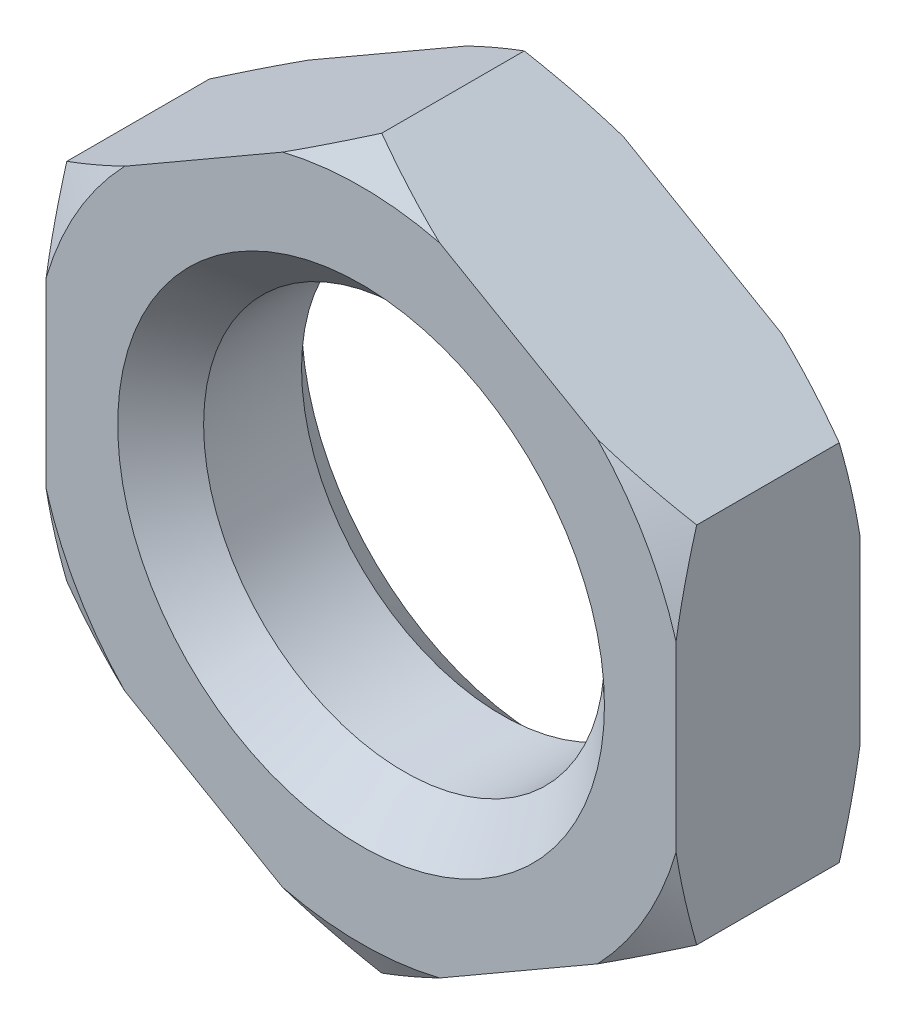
ISO-10303-21;
HEADER;
FILE_DESCRIPTION(('STEP AP214'),'2;1');
FILE_NAME('part.step','',(''),(''),'','','');
FILE_SCHEMA(('AUTOMOTIVE_DESIGN { 1 0 10303 214 1 1 1 1 }'));
ENDSEC;
DATA;
#1=APPLICATION_CONTEXT('core data for automotive mechanical design processes');
#2=APPLICATION_PROTOCOL_DEFINITION('international standard','automotive_design',2000,#1);
#3=PRODUCT_CONTEXT('',#1,'mechanical');
#4=PRODUCT('Part','Part','',(#3));
#5=PRODUCT_RELATED_PRODUCT_CATEGORY('part','',(#4));
#6=PRODUCT_DEFINITION_FORMATION('','',#4);
#7=PRODUCT_DEFINITION_CONTEXT('part definition',#1,'design');
#8=PRODUCT_DEFINITION('design','',#6,#7);
#9=PRODUCT_DEFINITION_SHAPE('','',#8);
#10=(LENGTH_UNIT() NAMED_UNIT(*) SI_UNIT(.MILLI.,.METRE.));
#11=(NAMED_UNIT(*) PLANE_ANGLE_UNIT() SI_UNIT($,.RADIAN.));
#12=(NAMED_UNIT(*) SI_UNIT($,.STERADIAN.) SOLID_ANGLE_UNIT());
#13=UNCERTAINTY_MEASURE_WITH_UNIT(LENGTH_MEASURE(1.E-05),#10,'distance_accuracy_value','');
#14=(GEOMETRIC_REPRESENTATION_CONTEXT(3) GLOBAL_UNCERTAINTY_ASSIGNED_CONTEXT((#13)) GLOBAL_UNIT_ASSIGNED_CONTEXT((#10,
#11,#12)) REPRESENTATION_CONTEXT('',''));
#15=CARTESIAN_POINT('',(0.,0.,0.));
#16=DIRECTION('',(0.,0.,1.));
#17=DIRECTION('',(1.,0.,0.));
#18=AXIS2_PLACEMENT_3D('',#15,#16,#17);
#19=CARTESIAN_POINT('',(0.,0.,-3.21));
#20=DIRECTION('',(0.,0.,1.));
#21=DIRECTION('',(1.,0.,0.));
#22=AXIS2_PLACEMENT_3D('',#19,#20,#21);
#23=PLANE('',#22);
#24=CARTESIAN_POINT('',(0.,0.,-3.21));
#25=DIRECTION('',(0.,0.,1.));
#26=DIRECTION('',(1.,0.,0.));
#27=AXIS2_PLACEMENT_3D('',#24,#25,#26);
#28=CIRCLE('',#27,8.49999999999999);
#29=CARTESIAN_POINT('',(8.49999999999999,0.,-3.21));
#30=VERTEX_POINT('',#29);
#31=EDGE_CURVE('E431',#30,#30,#28,.T.);
#32=ORIENTED_EDGE('',*,*,#31,.T.);
#33=EDGE_LOOP('',(#32));
#34=FACE_BOUND('',#33,.T.);
#35=DIRECTION('',(0.,1.,0.));
#36=VECTOR('',#35,1.);
#37=CARTESIAN_POINT('',(11.,-6.35085296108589,-3.21));
#38=LINE('',#37,#36);
#39=CARTESIAN_POINT('',(11.,-3.18458294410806,-3.21));
#40=VERTEX_POINT('',#39);
#41=CARTESIAN_POINT('',(11.,3.18458294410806,-3.21));
#42=VERTEX_POINT('',#41);
#43=EDGE_CURVE('E363',#40,#42,#38,.T.);
#44=ORIENTED_EDGE('',*,*,#43,.F.);
#45=CARTESIAN_POINT('',(0.,0.,-3.21));
#46=DIRECTION('',(0.,0.,-1.));
#47=DIRECTION('',(-1.,0.,0.));
#48=AXIS2_PLACEMENT_3D('',#45,#46,#47);
#49=CIRCLE('',#48,11.4517059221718);
#50=CARTESIAN_POINT('',(8.25792973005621,-7.9339879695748,-3.21));
#51=VERTEX_POINT('',#50);
#52=EDGE_CURVE('E351',#40,#51,#49,.T.);
#53=ORIENTED_EDGE('',*,*,#52,.T.);
#54=DIRECTION('',(0.866025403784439,0.5,0.));
#55=VECTOR('',#54,1.);
#56=CARTESIAN_POINT('',(0.,-12.7017059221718,-3.21));
#57=LINE('',#56,#55);
#58=CARTESIAN_POINT('',(2.74207026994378,-11.1185709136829,-3.21));
#59=VERTEX_POINT('',#58);
#60=EDGE_CURVE('E374',#59,#51,#57,.T.);
#61=ORIENTED_EDGE('',*,*,#60,.F.);
#62=CARTESIAN_POINT('',(-2.7420702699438,-11.1185709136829,-3.21));
#63=VERTEX_POINT('',#62);
#64=EDGE_CURVE('E346',#59,#63,#49,.T.);
#65=ORIENTED_EDGE('',*,*,#64,.T.);
#66=DIRECTION('',(0.866025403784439,-0.5,0.));
#67=VECTOR('',#66,1.);
#68=CARTESIAN_POINT('',(-11.,-6.35085296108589,-3.21));
#69=LINE('',#68,#67);
#70=CARTESIAN_POINT('',(-8.25792973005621,-7.9339879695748,-3.21));
#71=VERTEX_POINT('',#70);
#72=EDGE_CURVE('E381',#71,#63,#69,.T.);
#73=ORIENTED_EDGE('',*,*,#72,.F.);
#74=CARTESIAN_POINT('',(-11.,-3.18458294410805,-3.21));
#75=VERTEX_POINT('',#74);
#76=EDGE_CURVE('E338',#71,#75,#49,.T.);
#77=ORIENTED_EDGE('',*,*,#76,.T.);
#78=DIRECTION('',(0.,-1.,0.));
#79=VECTOR('',#78,1.);
#80=CARTESIAN_POINT('',(-11.,6.35085296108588,-3.21));
#81=LINE('',#80,#79);
#82=CARTESIAN_POINT('',(-11.,3.18458294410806,-3.21));
#83=VERTEX_POINT('',#82);
#84=EDGE_CURVE('E480',#83,#75,#81,.T.);
#85=ORIENTED_EDGE('',*,*,#84,.F.);
#86=CARTESIAN_POINT('',(-8.25792973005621,7.9339879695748,-3.21));
#87=VERTEX_POINT('',#86);
#88=EDGE_CURVE('E63',#83,#87,#49,.T.);
#89=ORIENTED_EDGE('',*,*,#88,.T.);
#90=DIRECTION('',(-0.866025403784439,-0.5,0.));
#91=VECTOR('',#90,1.);
#92=CARTESIAN_POINT('',(0.,12.7017059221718,-3.21));
#93=LINE('',#92,#91);
#94=CARTESIAN_POINT('',(-2.74207026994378,11.1185709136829,-3.21));
#95=VERTEX_POINT('',#94);
#96=EDGE_CURVE('E181',#95,#87,#93,.T.);
#97=ORIENTED_EDGE('',*,*,#96,.F.);
#98=CARTESIAN_POINT('',(2.7420702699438,11.1185709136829,-3.21));
#99=VERTEX_POINT('',#98);
#100=EDGE_CURVE('E55',#95,#99,#49,.T.);
#101=ORIENTED_EDGE('',*,*,#100,.T.);
#102=DIRECTION('',(-0.866025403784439,0.5,0.));
#103=VECTOR('',#102,1.);
#104=CARTESIAN_POINT('',(11.,6.35085296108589,-3.21));
#105=LINE('',#104,#103);
#106=CARTESIAN_POINT('',(8.25792973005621,7.9339879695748,-3.21));
#107=VERTEX_POINT('',#106);
#108=EDGE_CURVE('E364',#107,#99,#105,.T.);
#109=ORIENTED_EDGE('',*,*,#108,.F.);
#110=EDGE_CURVE('E343',#107,#42,#49,.T.);
#111=ORIENTED_EDGE('',*,*,#110,.T.);
#112=EDGE_LOOP('',(#44,#53,#61,#65,#73,#77,#85,#89,#97,#101,#109,#111));
#113=FACE_BOUND('',#112,.T.);
#114=ADVANCED_FACE('F39',(#34,#113),#23,.F.);
#115=CARTESIAN_POINT('',(0.,0.,3.21));
#116=DIRECTION('',(0.,0.,1.));
#117=DIRECTION('',(1.,0.,0.));
#118=AXIS2_PLACEMENT_3D('',#115,#116,#117);
#119=PLANE('',#118);
#120=CARTESIAN_POINT('',(0.,0.,3.21));
#121=DIRECTION('',(0.,0.,1.));
#122=DIRECTION('',(1.,0.,0.));
#123=AXIS2_PLACEMENT_3D('',#120,#121,#122);
#124=CIRCLE('',#123,8.50000000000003);
#125=CARTESIAN_POINT('',(8.50000000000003,0.,3.21));
#126=VERTEX_POINT('',#125);
#127=EDGE_CURVE('E11',#126,#126,#124,.F.);
#128=ORIENTED_EDGE('',*,*,#127,.T.);
#129=EDGE_LOOP('',(#128));
#130=FACE_BOUND('',#129,.T.);
#131=CARTESIAN_POINT('',(0.,0.,3.21));
#132=DIRECTION('',(0.,0.,-1.));
#133=DIRECTION('',(-1.,0.,0.));
#134=AXIS2_PLACEMENT_3D('',#131,#132,#133);
#135=CIRCLE('',#134,11.4517059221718);
#136=CARTESIAN_POINT('',(11.,-3.18458294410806,3.21));
#137=VERTEX_POINT('',#136);
#138=CARTESIAN_POINT('',(8.25792973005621,-7.9339879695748,3.21));
#139=VERTEX_POINT('',#138);
#140=EDGE_CURVE('E315',#137,#139,#135,.T.);
#141=ORIENTED_EDGE('',*,*,#140,.F.);
#142=DIRECTION('',(0.,1.,0.));
#143=VECTOR('',#142,1.);
#144=CARTESIAN_POINT('',(11.,-6.35085296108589,3.21));
#145=LINE('',#144,#143);
#146=CARTESIAN_POINT('',(11.,3.18458294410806,3.21));
#147=VERTEX_POINT('',#146);
#148=EDGE_CURVE('E389',#137,#147,#145,.T.);
#149=ORIENTED_EDGE('',*,*,#148,.T.);
#150=CARTESIAN_POINT('',(8.25792973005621,7.9339879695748,3.21));
#151=VERTEX_POINT('',#150);
#152=EDGE_CURVE('E307',#151,#147,#135,.T.);
#153=ORIENTED_EDGE('',*,*,#152,.F.);
#154=DIRECTION('',(-0.866025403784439,0.5,0.));
#155=VECTOR('',#154,1.);
#156=CARTESIAN_POINT('',(11.,6.35085296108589,3.21));
#157=LINE('',#156,#155);
#158=CARTESIAN_POINT('',(2.7420702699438,11.1185709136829,3.21));
#159=VERTEX_POINT('',#158);
#160=EDGE_CURVE('E373',#151,#159,#157,.T.);
#161=ORIENTED_EDGE('',*,*,#160,.T.);
#162=CARTESIAN_POINT('',(-2.74207026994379,11.1185709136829,3.21));
#163=VERTEX_POINT('',#162);
#164=EDGE_CURVE('E297',#163,#159,#135,.T.);
#165=ORIENTED_EDGE('',*,*,#164,.F.);
#166=DIRECTION('',(-0.866025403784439,-0.5,0.));
#167=VECTOR('',#166,1.);
#168=CARTESIAN_POINT('',(0.,12.7017059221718,3.21));
#169=LINE('',#168,#167);
#170=CARTESIAN_POINT('',(-8.25792973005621,7.9339879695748,3.21));
#171=VERTEX_POINT('',#170);
#172=EDGE_CURVE('E379',#163,#171,#169,.T.);
#173=ORIENTED_EDGE('',*,*,#172,.T.);
#174=CARTESIAN_POINT('',(-11.,3.18458294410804,3.21));
#175=VERTEX_POINT('',#174);
#176=EDGE_CURVE('E295',#175,#171,#135,.T.);
#177=ORIENTED_EDGE('',*,*,#176,.F.);
#178=DIRECTION('',(0.,-1.,0.));
#179=VECTOR('',#178,1.);
#180=CARTESIAN_POINT('',(-11.,6.35085296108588,3.21));
#181=LINE('',#180,#179);
#182=CARTESIAN_POINT('',(-11.,-3.18458294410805,3.21));
#183=VERTEX_POINT('',#182);
#184=EDGE_CURVE('E493',#175,#183,#181,.T.);
#185=ORIENTED_EDGE('',*,*,#184,.T.);
#186=CARTESIAN_POINT('',(-8.25792973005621,-7.93398796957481,3.21));
#187=VERTEX_POINT('',#186);
#188=EDGE_CURVE('E298',#187,#183,#135,.T.);
#189=ORIENTED_EDGE('',*,*,#188,.F.);
#190=DIRECTION('',(0.866025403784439,-0.5,0.));
#191=VECTOR('',#190,1.);
#192=CARTESIAN_POINT('',(-11.,-6.35085296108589,3.21));
#193=LINE('',#192,#191);
#194=CARTESIAN_POINT('',(-2.7420702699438,-11.1185709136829,3.21));
#195=VERTEX_POINT('',#194);
#196=EDGE_CURVE('E471',#187,#195,#193,.T.);
#197=ORIENTED_EDGE('',*,*,#196,.T.);
#198=CARTESIAN_POINT('',(2.74207026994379,-11.1185709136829,3.21));
#199=VERTEX_POINT('',#198);
#200=EDGE_CURVE('E309',#199,#195,#135,.T.);
#201=ORIENTED_EDGE('',*,*,#200,.F.);
#202=DIRECTION('',(0.866025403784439,0.5,0.));
#203=VECTOR('',#202,1.);
#204=CARTESIAN_POINT('',(0.,-12.7017059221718,3.21));
#205=LINE('',#204,#203);
#206=EDGE_CURVE('E468',#199,#139,#205,.T.);
#207=ORIENTED_EDGE('',*,*,#206,.T.);
#208=EDGE_LOOP('',(#141,#149,#153,#161,#165,#173,#177,#185,#189,#197,#201,#207));
#209=FACE_BOUND('',#208,.T.);
#210=ADVANCED_FACE('F422',(#130,#209),#119,.T.);
#211=CARTESIAN_POINT('',(11.,6.35085296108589,3.21));
#212=DIRECTION('',(-0.5,-0.866025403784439,0.));
#213=DIRECTION('',(0.866025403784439,-0.5,0.));
#214=AXIS2_PLACEMENT_3D('',#211,#212,#213);
#215=PLANE('',#214);
#216=DIRECTION('',(0.,0.,-1.));
#217=VECTOR('',#216,1.);
#218=CARTESIAN_POINT('',(11.,6.35085296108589,3.21));
#219=LINE('',#218,#217);
#220=CARTESIAN_POINT('',(11.,6.35085296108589,2.48831216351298));
#221=VERTEX_POINT('',#220);
#222=CARTESIAN_POINT('',(11.,6.35085296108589,-2.48831216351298));
#223=VERTEX_POINT('',#222);
#224=EDGE_CURVE('E385',#221,#223,#219,.T.);
#225=ORIENTED_EDGE('',*,*,#224,.T.);
#226=CARTESIAN_POINT('',(18.6335151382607,1.94364094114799,0.994786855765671));
#227=CARTESIAN_POINT('',(18.2879314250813,2.14316379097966,0.808331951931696));
#228=CARTESIAN_POINT('',(17.9415203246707,2.34316433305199,0.623890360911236));
#229=CARTESIAN_POINT('',(17.2466944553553,2.74432223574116,0.259979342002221));
#230=CARTESIAN_POINT('',(16.8982794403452,2.94547973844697,0.0805105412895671));
#231=CARTESIAN_POINT('',(16.1980602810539,3.34975145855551,-0.27302915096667));
#232=CARTESIAN_POINT('',(15.8462488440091,3.55286988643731,-0.447080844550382));
#233=CARTESIAN_POINT('',(15.1399890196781,3.96062918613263,-0.787882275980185));
#234=CARTESIAN_POINT('',(14.785540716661,4.16527000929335,-0.954632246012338));
#235=CARTESIAN_POINT('',(14.0645488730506,4.58153484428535,-1.28335107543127));
#236=CARTESIAN_POINT('',(13.6979267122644,4.79320424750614,-1.44509108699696));
#237=CARTESIAN_POINT('',(12.9609831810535,5.21867879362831,-1.75703937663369));
#238=CARTESIAN_POINT('',(12.5906616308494,5.43248404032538,-1.90724709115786));
#239=CARTESIAN_POINT('',(11.8462339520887,5.86227956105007,-2.1932690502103));
#240=CARTESIAN_POINT('',(11.4721318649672,6.07826750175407,-2.32909718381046));
#241=CARTESIAN_POINT('',(10.7195355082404,6.5127792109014,-2.58322237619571));
#242=CARTESIAN_POINT('',(10.3410418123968,6.7313026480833,-2.70152169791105));
#243=CARTESIAN_POINT('',(9.43580942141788,7.25393881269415,-2.9573894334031));
#244=CARTESIAN_POINT('',(8.90696128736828,7.55926942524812,-3.08541669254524));
#245=CARTESIAN_POINT('',(8.10828712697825,8.0203841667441,-3.23924140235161));
#246=CARTESIAN_POINT('',(7.84117502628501,8.17460140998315,-3.28414570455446));
#247=CARTESIAN_POINT('',(7.30545484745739,8.48389959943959,-3.3600933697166));
#248=CARTESIAN_POINT('',(7.03684678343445,8.63898053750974,-3.3911368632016));
#249=CARTESIAN_POINT('',(6.50177331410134,8.94790534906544,-3.43819329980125));
#250=CARTESIAN_POINT('',(6.23531918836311,9.10174271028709,-3.45437638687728));
#251=CARTESIAN_POINT('',(5.70204360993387,9.40962950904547,-3.47184560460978));
#252=CARTESIAN_POINT('',(5.43522216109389,9.56367894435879,-3.47313189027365));
#253=CARTESIAN_POINT('',(4.90184179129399,9.87162624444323,-3.4607665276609));
#254=CARTESIAN_POINT('',(4.63528286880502,10.0255241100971,-3.44711496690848));
#255=CARTESIAN_POINT('',(4.10299301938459,10.3328417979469,-3.40528697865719));
#256=CARTESIAN_POINT('',(3.83726222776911,10.4862615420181,-3.37710829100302));
#257=CARTESIAN_POINT('',(3.20938317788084,10.8487676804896,-3.29407787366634));
#258=CARTESIAN_POINT('',(2.84782591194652,11.0575128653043,-3.23322140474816));
#259=CARTESIAN_POINT('',(2.12817471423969,11.4730036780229,-3.08859872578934));
#260=CARTESIAN_POINT('',(1.77008129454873,11.6797490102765,-3.0048291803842));
#261=CARTESIAN_POINT('',(1.05740050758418,12.0912154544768,-2.81754283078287));
#262=CARTESIAN_POINT('',(0.702817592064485,12.2959339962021,-2.71400367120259));
#263=CARTESIAN_POINT('',(-0.00236665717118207,12.7030723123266,-2.49043986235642));
#264=CARTESIAN_POINT('',(-0.352968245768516,12.9054922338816,-2.3704162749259));
#265=CARTESIAN_POINT('',(-1.0545817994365,13.3105690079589,-2.11522486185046));
#266=CARTESIAN_POINT('',(-1.4055488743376,13.5131999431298,-1.97989362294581));
#267=CARTESIAN_POINT('',(-2.10376493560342,13.9163151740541,-1.69787636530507));
#268=CARTESIAN_POINT('',(-2.45101621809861,14.1168007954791,-1.55119788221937));
#269=CARTESIAN_POINT('',(-3.14233425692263,14.5159334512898,-1.24850837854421));
#270=CARTESIAN_POINT('',(-3.48640184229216,14.7145809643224,-1.09249987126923));
#271=CARTESIAN_POINT('',(-4.17187978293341,15.1103418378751,-0.772758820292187));
#272=CARTESIAN_POINT('',(-4.51328977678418,15.3074549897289,-0.609025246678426));
#273=CARTESIAN_POINT('',(-5.08837874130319,15.6394827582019,-0.326886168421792));
#274=CARTESIAN_POINT('',(-5.32267384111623,15.7747530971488,-0.210148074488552));
#275=CARTESIAN_POINT('',(-5.79024255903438,16.0447040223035,0.0260002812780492));
#276=CARTESIAN_POINT('',(-6.02351621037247,16.1793846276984,0.145410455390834));
#277=CARTESIAN_POINT('',(-6.4867029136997,16.4468055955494,0.385323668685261));
#278=CARTESIAN_POINT('',(-6.71662554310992,16.5795514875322,0.505802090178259));
#279=CARTESIAN_POINT('',(-7.17565929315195,16.8445747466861,0.748815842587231));
#280=CARTESIAN_POINT('',(-7.4047703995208,16.9768521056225,0.871351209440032));
#281=CARTESIAN_POINT('',(-7.6335151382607,17.1089179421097,0.994786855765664));
#282=B_SPLINE_CURVE_WITH_KNOTS('',3,(#226,#227,#228,#229,#230,#231,#232,#233,#234,#235,#236,
#237,#238,#239,#240,#241,#242,#243,#244,#245,#246,#247,#248,#249,#250,#251,#252,#253,#254,#255,
#256,#257,#258,#259,#260,#261,#262,#263,#264,#265,#266,#267,#268,#269,#270,#271,#272,#273,#274,
#275,#276,#277,#278,#279,#280,#281),.UNSPECIFIED.,.F.,.F.,(4,2,2,2,2,2,2,2,2,2,2,2,2,2,2,2,2,2,
2,2,2,2,2,2,2,2,2,4),(0.,1.32138698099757,2.64293986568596,3.96873925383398,5.29449645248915,
6.6539105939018,8.01339112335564,9.37154632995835,10.7295260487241,12.5993055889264,
13.5341056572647,14.4688969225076,15.3928467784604,16.3167870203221,17.2407218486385,
18.1648004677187,19.4297423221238,20.6948684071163,21.9614336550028,23.2279173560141,
24.5094921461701,25.7902230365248,27.0706104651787,28.3511690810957,29.2351122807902,
30.1190265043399,30.9936651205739,31.8683190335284),.UNSPECIFIED.);
#283=EDGE_CURVE('E319',#223,#107,#282,.T.);
#284=ORIENTED_EDGE('',*,*,#283,.T.);
#285=ORIENTED_EDGE('',*,*,#108,.T.);
#286=CARTESIAN_POINT('',(0.,12.7017059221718,-2.48831216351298));
#287=VERTEX_POINT('',#286);
#288=EDGE_CURVE('E310',#99,#287,#282,.T.);
#289=ORIENTED_EDGE('',*,*,#288,.T.);
#290=DIRECTION('',(0.,0.,-1.));
#291=VECTOR('',#290,1.);
#292=CARTESIAN_POINT('',(0.,12.7017059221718,3.21));
#293=LINE('',#292,#291);
#294=CARTESIAN_POINT('',(0.,12.7017059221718,2.48831216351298));
#295=VERTEX_POINT('',#294);
#296=EDGE_CURVE('E190',#295,#287,#293,.T.);
#297=ORIENTED_EDGE('',*,*,#296,.F.);
#298=CARTESIAN_POINT('',(-7.6335151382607,17.1089179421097,-0.994786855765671));
#299=CARTESIAN_POINT('',(-7.2879314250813,16.909395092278,-0.808331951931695));
#300=CARTESIAN_POINT('',(-6.9415203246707,16.7093945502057,-0.623890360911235));
#301=CARTESIAN_POINT('',(-6.24669445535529,16.3082366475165,-0.259979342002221));
#302=CARTESIAN_POINT('',(-5.89827944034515,16.1070791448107,-0.0805105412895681));
#303=CARTESIAN_POINT('',(-5.1980602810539,15.7028074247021,0.27302915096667));
#304=CARTESIAN_POINT('',(-4.8462488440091,15.4996889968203,0.447080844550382));
#305=CARTESIAN_POINT('',(-4.13998901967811,15.091929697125,0.787882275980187));
#306=CARTESIAN_POINT('',(-3.78554071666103,14.8872888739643,0.954632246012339));
#307=CARTESIAN_POINT('',(-3.0645488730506,14.4710240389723,1.28335107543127));
#308=CARTESIAN_POINT('',(-2.69792671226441,14.2593546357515,1.44509108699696));
#309=CARTESIAN_POINT('',(-1.9609831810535,13.8338800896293,1.75703937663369));
#310=CARTESIAN_POINT('',(-1.59066163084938,13.6200748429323,1.90724709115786));
#311=CARTESIAN_POINT('',(-0.846233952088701,13.1902793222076,2.1932690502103));
#312=CARTESIAN_POINT('',(-0.4721318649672,12.9742913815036,2.32909718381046));
#313=CARTESIAN_POINT('',(0.280464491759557,12.5397796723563,2.58322237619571));
#314=CARTESIAN_POINT('',(0.658958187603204,12.3212562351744,2.70152169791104));
#315=CARTESIAN_POINT('',(1.56419057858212,11.7986200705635,2.9573894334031));
#316=CARTESIAN_POINT('',(2.09303871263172,11.4932894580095,3.08541669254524));
#317=CARTESIAN_POINT('',(2.89171287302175,11.0321747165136,3.2392414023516));
#318=CARTESIAN_POINT('',(3.15882497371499,10.8779574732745,3.28414570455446));
#319=CARTESIAN_POINT('',(3.69454515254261,10.5686592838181,3.3600933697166));
#320=CARTESIAN_POINT('',(3.96315321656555,10.4135783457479,3.3911368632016));
#321=CARTESIAN_POINT('',(4.49822668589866,10.1046535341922,3.43819329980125));
#322=CARTESIAN_POINT('',(4.76468081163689,9.95081617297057,3.45437638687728));
#323=CARTESIAN_POINT('',(5.29795639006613,9.64292937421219,3.47184560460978));
#324=CARTESIAN_POINT('',(5.56477783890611,9.48887993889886,3.47313189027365));
#325=CARTESIAN_POINT('',(6.09815820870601,9.18093263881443,3.4607665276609));
#326=CARTESIAN_POINT('',(6.36471713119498,9.02703477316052,3.44711496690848));
#327=CARTESIAN_POINT('',(6.89700698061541,8.71971708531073,3.40528697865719));
#328=CARTESIAN_POINT('',(7.16273777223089,8.56629734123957,3.37710829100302));
#329=CARTESIAN_POINT('',(7.79061682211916,8.20379120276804,3.29407787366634));
#330=CARTESIAN_POINT('',(8.15217408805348,7.9950460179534,3.23322140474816));
#331=CARTESIAN_POINT('',(8.87182528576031,7.57955520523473,3.08859872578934));
#332=CARTESIAN_POINT('',(9.22991870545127,7.37280987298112,3.0048291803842));
#333=CARTESIAN_POINT('',(9.94259949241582,6.96134342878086,2.81754283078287));
#334=CARTESIAN_POINT('',(10.2971824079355,6.75662488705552,2.71400367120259));
#335=CARTESIAN_POINT('',(11.0023666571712,6.34948657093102,2.49043986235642));
#336=CARTESIAN_POINT('',(11.3529682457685,6.14706664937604,2.3704162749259));
#337=CARTESIAN_POINT('',(12.0545817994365,5.74198987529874,2.11522486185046));
#338=CARTESIAN_POINT('',(12.4055488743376,5.5393589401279,1.97989362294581));
#339=CARTESIAN_POINT('',(13.1037649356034,5.13624370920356,1.69787636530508));
#340=CARTESIAN_POINT('',(13.4510162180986,4.93575808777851,1.55119788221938));
#341=CARTESIAN_POINT('',(14.1423342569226,4.53662543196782,1.24850837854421));
#342=CARTESIAN_POINT('',(14.4864018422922,4.3379779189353,1.09249987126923));
#343=CARTESIAN_POINT('',(15.1718797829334,3.94221704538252,0.772758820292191));
#344=CARTESIAN_POINT('',(15.5132897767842,3.74510389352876,0.609025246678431));
#345=CARTESIAN_POINT('',(16.0883787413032,3.41307612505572,0.326886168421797));
#346=CARTESIAN_POINT('',(16.3226738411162,3.27780578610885,0.210148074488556));
#347=CARTESIAN_POINT('',(16.7902425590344,3.00785486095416,-0.026000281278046));
#348=CARTESIAN_POINT('',(17.0235162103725,2.87317425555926,-0.14541045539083));
#349=CARTESIAN_POINT('',(17.4867029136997,2.60575328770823,-0.385323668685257));
#350=CARTESIAN_POINT('',(17.7166255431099,2.47300739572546,-0.505802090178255));
#351=CARTESIAN_POINT('',(18.175659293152,2.20798413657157,-0.748815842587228));
#352=CARTESIAN_POINT('',(18.4047703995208,2.07570677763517,-0.87135120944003));
#353=CARTESIAN_POINT('',(18.6335151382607,1.94364094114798,-0.994786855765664));
#354=B_SPLINE_CURVE_WITH_KNOTS('',3,(#298,#299,#300,#301,#302,#303,#304,#305,#306,#307,#308,
#309,#310,#311,#312,#313,#314,#315,#316,#317,#318,#319,#320,#321,#322,#323,#324,#325,#326,#327,
#328,#329,#330,#331,#332,#333,#334,#335,#336,#337,#338,#339,#340,#341,#342,#343,#344,#345,#346,
#347,#348,#349,#350,#351,#352,#353),.UNSPECIFIED.,.F.,.F.,(4,2,2,2,2,2,2,2,2,2,2,2,2,2,2,2,2,2,
2,2,2,2,2,2,2,2,2,4),(0.,1.32138698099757,2.64293986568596,3.96873925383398,5.29449645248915,
6.6539105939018,8.01339112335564,9.37154632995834,10.7295260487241,12.5993055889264,
13.5341056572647,14.4688969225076,15.3928467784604,16.3167870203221,17.2407218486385,
18.1648004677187,19.4297423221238,20.6948684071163,21.9614336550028,23.2279173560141,
24.5094921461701,25.7902230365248,27.0706104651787,28.3511690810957,29.2351122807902,
30.1190265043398,30.9936651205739,31.8683190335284),.UNSPECIFIED.);
#355=EDGE_CURVE('E477',#295,#159,#354,.T.);
#356=ORIENTED_EDGE('',*,*,#355,.T.);
#357=ORIENTED_EDGE('',*,*,#160,.F.);
#358=EDGE_CURVE('E248',#151,#221,#354,.T.);
#359=ORIENTED_EDGE('',*,*,#358,.T.);
#360=EDGE_LOOP('',(#225,#284,#285,#289,#297,#356,#357,#359));
#361=FACE_BOUND('',#360,.T.);
#362=ADVANCED_FACE('F427',(#361),#215,.F.);
#363=CARTESIAN_POINT('',(0.,12.7017059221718,3.21));
#364=DIRECTION('',(0.5,-0.866025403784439,0.));
#365=DIRECTION('',(0.866025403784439,0.5,0.));
#366=AXIS2_PLACEMENT_3D('',#363,#364,#365);
#367=PLANE('',#366);
#368=ORIENTED_EDGE('',*,*,#296,.T.);
#369=CARTESIAN_POINT('',(7.63351513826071,17.1089179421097,0.994786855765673));
#370=CARTESIAN_POINT('',(7.28793142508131,16.909395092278,0.808331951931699));
#371=CARTESIAN_POINT('',(6.94152032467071,16.7093945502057,0.623890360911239));
#372=CARTESIAN_POINT('',(6.2466944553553,16.3082366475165,0.259979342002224));
#373=CARTESIAN_POINT('',(5.89827944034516,16.1070791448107,0.0805105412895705));
#374=CARTESIAN_POINT('',(5.19806028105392,15.7028074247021,-0.273029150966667));
#375=CARTESIAN_POINT('',(4.84624884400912,15.4996889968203,-0.447080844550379));
#376=CARTESIAN_POINT('',(4.13998901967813,15.091929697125,-0.787882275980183));
#377=CARTESIAN_POINT('',(3.78554071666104,14.8872888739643,-0.954632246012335));
#378=CARTESIAN_POINT('',(3.06454887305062,14.4710240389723,-1.28335107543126));
#379=CARTESIAN_POINT('',(2.69792671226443,14.2593546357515,-1.44509108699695));
#380=CARTESIAN_POINT('',(1.96098318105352,13.8338800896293,-1.75703937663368));
#381=CARTESIAN_POINT('',(1.5906616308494,13.6200748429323,-1.90724709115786));
#382=CARTESIAN_POINT('',(0.846233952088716,13.1902793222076,-2.1932690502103));
#383=CARTESIAN_POINT('',(0.472131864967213,12.9742913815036,-2.32909718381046));
#384=CARTESIAN_POINT('',(-0.280464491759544,12.5397796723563,-2.5832223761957));
#385=CARTESIAN_POINT('',(-0.65895818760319,12.3212562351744,-2.70152169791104));
#386=CARTESIAN_POINT('',(-1.5641905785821,11.7986200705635,-2.9573894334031));
#387=CARTESIAN_POINT('',(-2.09303871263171,11.4932894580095,-3.08541669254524));
#388=CARTESIAN_POINT('',(-2.89171287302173,11.0321747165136,-3.2392414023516));
#389=CARTESIAN_POINT('',(-3.15882497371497,10.8779574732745,-3.28414570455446));
#390=CARTESIAN_POINT('',(-3.69454515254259,10.5686592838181,-3.3600933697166));
#391=CARTESIAN_POINT('',(-3.96315321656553,10.4135783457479,-3.3911368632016));
#392=CARTESIAN_POINT('',(-4.49822668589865,10.1046535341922,-3.43819329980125));
#393=CARTESIAN_POINT('',(-4.76468081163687,9.95081617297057,-3.45437638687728));
#394=CARTESIAN_POINT('',(-5.29795639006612,9.6429293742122,-3.47184560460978));
#395=CARTESIAN_POINT('',(-5.5647778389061,9.48887993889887,-3.47313189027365));
#396=CARTESIAN_POINT('',(-6.098158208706,9.18093263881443,-3.4607665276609));
#397=CARTESIAN_POINT('',(-6.36471713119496,9.02703477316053,-3.44711496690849));
#398=CARTESIAN_POINT('',(-6.8970069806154,8.71971708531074,-3.40528697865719));
#399=CARTESIAN_POINT('',(-7.16273777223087,8.56629734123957,-3.37710829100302));
#400=CARTESIAN_POINT('',(-7.79061682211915,8.20379120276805,-3.29407787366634));
#401=CARTESIAN_POINT('',(-8.15217408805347,7.99504601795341,-3.23322140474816));
#402=CARTESIAN_POINT('',(-8.8718252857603,7.57955520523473,-3.08859872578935));
#403=CARTESIAN_POINT('',(-9.22991870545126,7.37280987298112,-3.00482918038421));
#404=CARTESIAN_POINT('',(-9.9425994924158,6.96134342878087,-2.81754283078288));
#405=CARTESIAN_POINT('',(-10.2971824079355,6.75662488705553,-2.7140036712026));
#406=CARTESIAN_POINT('',(-11.0023666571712,6.34948657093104,-2.49043986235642));
#407=CARTESIAN_POINT('',(-11.3529682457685,6.14706664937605,-2.37041627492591));
#408=CARTESIAN_POINT('',(-12.0545817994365,5.74198987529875,-2.11522486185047));
#409=CARTESIAN_POINT('',(-12.4055488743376,5.53935894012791,-1.97989362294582));
#410=CARTESIAN_POINT('',(-13.1037649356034,5.13624370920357,-1.69787636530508));
#411=CARTESIAN_POINT('',(-13.4510162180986,4.93575808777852,-1.55119788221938));
#412=CARTESIAN_POINT('',(-14.1423342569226,4.53662543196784,-1.24850837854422));
#413=CARTESIAN_POINT('',(-14.4864018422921,4.33797791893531,-1.09249987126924));
#414=CARTESIAN_POINT('',(-15.1718797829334,3.94221704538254,-0.7727588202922));
#415=CARTESIAN_POINT('',(-15.5132897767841,3.74510389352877,-0.609025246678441));
#416=CARTESIAN_POINT('',(-16.0883787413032,3.41307612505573,-0.326886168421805));
#417=CARTESIAN_POINT('',(-16.3226738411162,3.27780578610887,-0.210148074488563));
#418=CARTESIAN_POINT('',(-16.7902425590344,3.00785486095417,0.0260002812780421));
#419=CARTESIAN_POINT('',(-17.0235162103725,2.87317425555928,0.145410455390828));
#420=CARTESIAN_POINT('',(-17.4867029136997,2.60575328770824,0.385323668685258));
#421=CARTESIAN_POINT('',(-17.7166255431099,2.47300739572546,0.505802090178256));
#422=CARTESIAN_POINT('',(-18.175659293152,2.20798413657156,0.74881584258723));
#423=CARTESIAN_POINT('',(-18.4047703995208,2.07570677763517,0.871351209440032));
#424=CARTESIAN_POINT('',(-18.6335151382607,1.94364094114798,0.994786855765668));
#425=B_SPLINE_CURVE_WITH_KNOTS('',3,(#369,#370,#371,#372,#373,#374,#375,#376,#377,#378,#379,
#380,#381,#382,#383,#384,#385,#386,#387,#388,#389,#390,#391,#392,#393,#394,#395,#396,#397,#398,
#399,#400,#401,#402,#403,#404,#405,#406,#407,#408,#409,#410,#411,#412,#413,#414,#415,#416,#417,
#418,#419,#420,#421,#422,#423,#424),.UNSPECIFIED.,.F.,.F.,(4,2,2,2,2,2,2,2,2,2,2,2,2,2,2,2,2,2,
2,2,2,2,2,2,2,2,2,4),(0.,1.32138698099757,2.64293986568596,3.96873925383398,5.29449645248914,
6.65391059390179,8.01339112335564,9.37154632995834,10.7295260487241,12.5993055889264,
13.5341056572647,14.4688969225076,15.3928467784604,16.3167870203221,17.2407218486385,
18.1648004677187,19.4297423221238,20.6948684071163,21.9614336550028,23.2279173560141,
24.5094921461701,25.7902230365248,27.0706104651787,28.3511690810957,29.2351122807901,
30.1190265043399,30.9936651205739,31.8683190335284),.UNSPECIFIED.);
#426=EDGE_CURVE('E183',#287,#95,#425,.T.);
#427=ORIENTED_EDGE('',*,*,#426,.T.);
#428=ORIENTED_EDGE('',*,*,#96,.T.);
#429=CARTESIAN_POINT('',(-11.,6.35085296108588,-2.48831216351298));
#430=VERTEX_POINT('',#429);
#431=EDGE_CURVE('E165',#87,#430,#425,.T.);
#432=ORIENTED_EDGE('',*,*,#431,.T.);
#433=DIRECTION('',(0.,0.,-1.));
#434=VECTOR('',#433,1.);
#435=CARTESIAN_POINT('',(-11.,6.35085296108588,3.21));
#436=LINE('',#435,#434);
#437=CARTESIAN_POINT('',(-11.,6.35085296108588,2.48831216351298));
#438=VERTEX_POINT('',#437);
#439=EDGE_CURVE('E179',#438,#430,#436,.T.);
#440=ORIENTED_EDGE('',*,*,#439,.F.);
#441=CARTESIAN_POINT('',(-18.6335151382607,1.94364094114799,-0.994786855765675));
#442=CARTESIAN_POINT('',(-18.2879314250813,2.14316379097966,-0.808331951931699));
#443=CARTESIAN_POINT('',(-17.9415203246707,2.34316433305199,-0.623890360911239));
#444=CARTESIAN_POINT('',(-17.2466944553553,2.74432223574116,-0.259979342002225));
#445=CARTESIAN_POINT('',(-16.8982794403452,2.94547973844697,-0.0805105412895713));
#446=CARTESIAN_POINT('',(-16.1980602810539,3.34975145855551,0.273029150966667));
#447=CARTESIAN_POINT('',(-15.8462488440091,3.55286988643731,0.447080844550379));
#448=CARTESIAN_POINT('',(-15.1399890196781,3.96062918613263,0.787882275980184));
#449=CARTESIAN_POINT('',(-14.785540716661,4.16527000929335,0.954632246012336));
#450=CARTESIAN_POINT('',(-14.0645488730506,4.58153484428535,1.28335107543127));
#451=CARTESIAN_POINT('',(-13.6979267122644,4.79320424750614,1.44509108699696));
#452=CARTESIAN_POINT('',(-12.9609831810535,5.21867879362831,1.75703937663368));
#453=CARTESIAN_POINT('',(-12.5906616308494,5.43248404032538,1.90724709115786));
#454=CARTESIAN_POINT('',(-11.8462339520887,5.86227956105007,2.1932690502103));
#455=CARTESIAN_POINT('',(-11.4721318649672,6.07826750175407,2.32909718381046));
#456=CARTESIAN_POINT('',(-10.7195355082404,6.51277921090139,2.58322237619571));
#457=CARTESIAN_POINT('',(-10.3410418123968,6.7313026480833,2.70152169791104));
#458=CARTESIAN_POINT('',(-9.43580942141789,7.25393881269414,2.9573894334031));
#459=CARTESIAN_POINT('',(-8.90696128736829,7.55926942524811,3.08541669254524));
#460=CARTESIAN_POINT('',(-8.10828712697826,8.02038416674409,3.23924140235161));
#461=CARTESIAN_POINT('',(-7.84117502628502,8.17460140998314,3.28414570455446));
#462=CARTESIAN_POINT('',(-7.3054548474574,8.48389959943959,3.3600933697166));
#463=CARTESIAN_POINT('',(-7.03684678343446,8.63898053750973,3.3911368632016));
#464=CARTESIAN_POINT('',(-6.50177331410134,8.94790534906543,3.43819329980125));
#465=CARTESIAN_POINT('',(-6.23531918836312,9.10174271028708,3.45437638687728));
#466=CARTESIAN_POINT('',(-5.70204360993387,9.40962950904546,3.47184560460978));
#467=CARTESIAN_POINT('',(-5.43522216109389,9.56367894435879,3.47313189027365));
#468=CARTESIAN_POINT('',(-4.90184179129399,9.87162624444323,3.4607665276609));
#469=CARTESIAN_POINT('',(-4.63528286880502,10.0255241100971,3.44711496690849));
#470=CARTESIAN_POINT('',(-4.10299301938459,10.3328417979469,3.40528697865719));
#471=CARTESIAN_POINT('',(-3.83726222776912,10.4862615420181,3.37710829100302));
#472=CARTESIAN_POINT('',(-3.20938317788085,10.8487676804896,3.29407787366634));
#473=CARTESIAN_POINT('',(-2.84782591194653,11.0575128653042,3.23322140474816));
#474=CARTESIAN_POINT('',(-2.1281747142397,11.4730036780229,3.08859872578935));
#475=CARTESIAN_POINT('',(-1.77008129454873,11.6797490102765,3.00482918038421));
#476=CARTESIAN_POINT('',(-1.05740050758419,12.0912154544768,2.81754283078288));
#477=CARTESIAN_POINT('',(-0.702817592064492,12.2959339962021,2.71400367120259));
#478=CARTESIAN_POINT('',(0.00236665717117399,12.7030723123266,2.49043986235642));
#479=CARTESIAN_POINT('',(0.352968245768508,12.9054922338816,2.3704162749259));
#480=CARTESIAN_POINT('',(1.05458179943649,13.3105690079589,2.11522486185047));
#481=CARTESIAN_POINT('',(1.40554887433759,13.5131999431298,1.97989362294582));
#482=CARTESIAN_POINT('',(2.10376493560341,13.9163151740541,1.69787636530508));
#483=CARTESIAN_POINT('',(2.45101621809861,14.1168007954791,1.55119788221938));
#484=CARTESIAN_POINT('',(3.14233425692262,14.5159334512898,1.24850837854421));
#485=CARTESIAN_POINT('',(3.48640184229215,14.7145809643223,1.09249987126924));
#486=CARTESIAN_POINT('',(4.1718797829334,15.1103418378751,0.772758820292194));
#487=CARTESIAN_POINT('',(4.51328977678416,15.3074549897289,0.609025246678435));
#488=CARTESIAN_POINT('',(5.08837874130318,15.6394827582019,0.3268861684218));
#489=CARTESIAN_POINT('',(5.32267384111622,15.7747530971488,0.210148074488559));
#490=CARTESIAN_POINT('',(5.79024255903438,16.0447040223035,-0.0260002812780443));
#491=CARTESIAN_POINT('',(6.02351621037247,16.1793846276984,-0.14541045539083));
#492=CARTESIAN_POINT('',(6.4867029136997,16.4468055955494,-0.385323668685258));
#493=CARTESIAN_POINT('',(6.71662554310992,16.5795514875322,-0.505802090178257));
#494=CARTESIAN_POINT('',(7.17565929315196,16.8445747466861,-0.748815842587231));
#495=CARTESIAN_POINT('',(7.40477039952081,16.9768521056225,-0.871351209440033));
#496=CARTESIAN_POINT('',(7.63351513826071,17.1089179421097,-0.994786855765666));
#497=B_SPLINE_CURVE_WITH_KNOTS('',3,(#441,#442,#443,#444,#445,#446,#447,#448,#449,#450,#451,
#452,#453,#454,#455,#456,#457,#458,#459,#460,#461,#462,#463,#464,#465,#466,#467,#468,#469,#470,
#471,#472,#473,#474,#475,#476,#477,#478,#479,#480,#481,#482,#483,#484,#485,#486,#487,#488,#489,
#490,#491,#492,#493,#494,#495,#496),.UNSPECIFIED.,.F.,.F.,(4,2,2,2,2,2,2,2,2,2,2,2,2,2,2,2,2,2,
2,2,2,2,2,2,2,2,2,4),(0.,1.32138698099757,2.64293986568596,3.96873925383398,5.29449645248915,
6.6539105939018,8.01339112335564,9.37154632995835,10.7295260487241,12.5993055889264,
13.5341056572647,14.4688969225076,15.3928467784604,16.3167870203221,17.2407218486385,
18.1648004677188,19.4297423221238,20.6948684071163,21.9614336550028,23.2279173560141,
24.5094921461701,25.7902230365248,27.0706104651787,28.3511690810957,29.2351122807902,
30.1190265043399,30.9936651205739,31.8683190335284),.UNSPECIFIED.);
#498=EDGE_CURVE('E268',#438,#171,#497,.T.);
#499=ORIENTED_EDGE('',*,*,#498,.T.);
#500=ORIENTED_EDGE('',*,*,#172,.F.);
#501=EDGE_CURVE('E487',#163,#295,#497,.T.);
#502=ORIENTED_EDGE('',*,*,#501,.T.);
#503=EDGE_LOOP('',(#368,#427,#428,#432,#440,#499,#500,#502));
#504=FACE_BOUND('',#503,.T.);
#505=ADVANCED_FACE('F177',(#504),#367,.F.);
#506=CARTESIAN_POINT('',(-11.,6.35085296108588,3.21));
#507=DIRECTION('',(1.,0.,0.));
#508=DIRECTION('',(0.,1.,0.));
#509=AXIS2_PLACEMENT_3D('',#506,#507,#508);
#510=PLANE('',#509);
#511=ORIENTED_EDGE('',*,*,#439,.T.);
#512=CARTESIAN_POINT('',(-11.,13.9843680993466,0.450688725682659));
#513=CARTESIAN_POINT('',(-11.,13.5869860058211,0.270409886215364));
#514=CARTESIAN_POINT('',(-11.,13.1885164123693,0.092482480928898));
#515=CARTESIAN_POINT('',(-11.,12.3889363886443,-0.257528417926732));
#516=CARTESIAN_POINT('',(-11.,11.9878254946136,-0.429610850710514));
#517=CARTESIAN_POINT('',(-11.,11.1809569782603,-0.767429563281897));
#518=CARTESIAN_POINT('',(-11.,10.7751869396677,-0.933136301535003));
#519=CARTESIAN_POINT('',(-11.,9.96021537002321,-1.25586287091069));
#520=CARTESIAN_POINT('',(-11.,9.55101399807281,-1.41288310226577));
#521=CARTESIAN_POINT('',(-11.,8.73052424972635,-1.71562018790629));
#522=CARTESIAN_POINT('',(-11.,8.31925356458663,-1.86138475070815));
#523=CARTESIAN_POINT('',(-11.,7.49231521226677,-2.14002115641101));
#524=CARTESIAN_POINT('',(-11.,7.07664732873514,-2.27289236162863));
#525=CARTESIAN_POINT('',(-11.,6.24111293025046,-2.52269692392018));
#526=CARTESIAN_POINT('',(-11.,5.82125268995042,-2.63965111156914));
#527=CARTESIAN_POINT('',(-11.,4.97667458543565,-2.85449110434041));
#528=CARTESIAN_POINT('',(-11.,4.55195740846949,-2.95237957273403));
#529=CARTESIAN_POINT('',(-11.,3.81871748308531,-3.10102056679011));
#530=CARTESIAN_POINT('',(-11.,3.5113093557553,-3.15727394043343));
#531=CARTESIAN_POINT('',(-11.,2.89439397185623,-3.25684430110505));
#532=CARTESIAN_POINT('',(-11.,2.5848867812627,-3.30016169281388));
#533=CARTESIAN_POINT('',(-11.,1.96429226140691,-3.37271386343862));
#534=CARTESIAN_POINT('',(-11.,1.65320535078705,-3.40195219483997));
#535=CARTESIAN_POINT('',(-11.,1.02997954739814,-3.44551290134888));
#536=CARTESIAN_POINT('',(-11.,0.717840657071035,-3.4598353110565));
#537=CARTESIAN_POINT('',(-11.,0.0933911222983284,-3.47311741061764));
#538=CARTESIAN_POINT('',(-11.,-0.218919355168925,-3.47208487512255));
#539=CARTESIAN_POINT('',(-11.,-0.843108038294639,-3.45470893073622));
#540=CARTESIAN_POINT('',(-11.,-1.15498624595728,-3.43836559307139));
#541=CARTESIAN_POINT('',(-11.,-1.77763682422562,-3.39086700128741));
#542=CARTESIAN_POINT('',(-11.,-2.08840907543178,-3.35971019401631));
#543=CARTESIAN_POINT('',(-11.,-2.70823345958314,-3.28348106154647));
#544=CARTESIAN_POINT('',(-11.,-3.01728552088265,-3.23840816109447));
#545=CARTESIAN_POINT('',(-11.,-3.78669509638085,-3.10986323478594));
#546=CARTESIAN_POINT('',(-11.,-4.24573156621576,-3.01844774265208));
#547=CARTESIAN_POINT('',(-11.,-5.15830298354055,-2.81137318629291));
#548=CARTESIAN_POINT('',(-11.,-5.61183669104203,-2.69570876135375));
#549=CARTESIAN_POINT('',(-11.,-6.51429896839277,-2.44421291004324));
#550=CARTESIAN_POINT('',(-11.,-6.96321521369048,-2.30833768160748));
#551=CARTESIAN_POINT('',(-11.,-7.85576181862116,-2.02044950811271));
#552=CARTESIAN_POINT('',(-11.,-8.29939254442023,-1.86843768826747));
#553=CARTESIAN_POINT('',(-11.,-9.18698905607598,-1.5496309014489));
#554=CARTESIAN_POINT('',(-11.,-9.63090112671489,-1.38268730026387));
#555=CARTESIAN_POINT('',(-11.,-10.5145772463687,-1.03813485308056));
#556=CARTESIAN_POINT('',(-11.,-10.9543410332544,-0.860525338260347));
#557=CARTESIAN_POINT('',(-11.,-11.827576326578,-0.497837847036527));
#558=CARTESIAN_POINT('',(-11.,-12.2610699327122,-0.312812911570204));
#559=CARTESIAN_POINT('',(-11.,-12.9089886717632,-0.0301177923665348));
#560=CARTESIAN_POINT('',(-11.,-13.1245499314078,0.0649622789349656));
#561=CARTESIAN_POINT('',(-11.,-13.554970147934,0.256689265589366));
#562=CARTESIAN_POINT('',(-11.,-13.7698291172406,0.353336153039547));
#563=CARTESIAN_POINT('',(-11.,-13.9843680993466,0.450688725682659));
#564=B_SPLINE_CURVE_WITH_KNOTS('',3,(#512,#513,#514,#515,#516,#517,#518,#519,#520,#521,#522,
#523,#524,#525,#526,#527,#528,#529,#530,#531,#532,#533,#534,#535,#536,#537,#538,#539,#540,#541,
#542,#543,#544,#545,#546,#547,#548,#549,#550,#551,#552,#553,#554,#555,#556,#557,#558,#559,#560,
#561,#562,#563),.UNSPECIFIED.,.F.,.F.,(4,2,2,2,2,2,2,2,2,2,2,2,2,2,2,2,2,2,2,2,2,2,2,2,2,4),(0.,
1.3091106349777,2.61845760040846,3.9332789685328,5.24803970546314,6.55688096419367,
7.86578692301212,9.17296309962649,10.479956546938,11.4172554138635,12.3545249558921,
13.2915578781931,14.2285886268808,15.1651449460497,16.1016969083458,17.0383470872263,
17.9750359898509,19.3783456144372,20.7819657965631,22.1886735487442,23.5952832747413,
25.0179111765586,26.4406283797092,27.8545381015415,28.5613300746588,29.2681094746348),.UNSPECIFIED.);
#565=EDGE_CURVE('E162',#430,#83,#564,.T.);
#566=ORIENTED_EDGE('',*,*,#565,.T.);
#567=ORIENTED_EDGE('',*,*,#84,.T.);
#568=CARTESIAN_POINT('',(-11.,-6.35085296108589,-2.48831216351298));
#569=VERTEX_POINT('',#568);
#570=EDGE_CURVE('E171',#75,#569,#564,.T.);
#571=ORIENTED_EDGE('',*,*,#570,.T.);
#572=DIRECTION('',(0.,0.,-1.));
#573=VECTOR('',#572,1.);
#574=CARTESIAN_POINT('',(-11.,-6.35085296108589,3.21));
#575=LINE('',#574,#573);
#576=CARTESIAN_POINT('',(-11.,-6.35085296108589,2.48831216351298));
#577=VERTEX_POINT('',#576);
#578=EDGE_CURVE('E191',#577,#569,#575,.T.);
#579=ORIENTED_EDGE('',*,*,#578,.F.);
#580=CARTESIAN_POINT('',(-11.,-13.9843680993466,-0.450688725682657));
#581=CARTESIAN_POINT('',(-11.,-13.5869860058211,-0.270409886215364));
#582=CARTESIAN_POINT('',(-11.,-13.1885164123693,-0.0924824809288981));
#583=CARTESIAN_POINT('',(-11.,-12.3889363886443,0.257528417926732));
#584=CARTESIAN_POINT('',(-11.,-11.9878254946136,0.429610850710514));
#585=CARTESIAN_POINT('',(-11.,-11.1809569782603,0.767429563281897));
#586=CARTESIAN_POINT('',(-11.,-10.7751869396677,0.933136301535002));
#587=CARTESIAN_POINT('',(-11.,-9.96021537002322,1.25586287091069));
#588=CARTESIAN_POINT('',(-11.,-9.55101399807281,1.41288310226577));
#589=CARTESIAN_POINT('',(-11.,-8.73052424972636,1.71562018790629));
#590=CARTESIAN_POINT('',(-11.,-8.31925356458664,1.86138475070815));
#591=CARTESIAN_POINT('',(-11.,-7.49231521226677,2.14002115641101));
#592=CARTESIAN_POINT('',(-11.,-7.07664732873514,2.27289236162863));
#593=CARTESIAN_POINT('',(-11.,-6.24111293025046,2.52269692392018));
#594=CARTESIAN_POINT('',(-11.,-5.82125268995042,2.63965111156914));
#595=CARTESIAN_POINT('',(-11.,-4.97667458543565,2.85449110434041));
#596=CARTESIAN_POINT('',(-11.,-4.55195740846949,2.95237957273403));
#597=CARTESIAN_POINT('',(-11.,-3.81871748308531,3.10102056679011));
#598=CARTESIAN_POINT('',(-11.,-3.5113093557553,3.15727394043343));
#599=CARTESIAN_POINT('',(-11.,-2.89439397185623,3.25684430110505));
#600=CARTESIAN_POINT('',(-11.,-2.5848867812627,3.30016169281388));
#601=CARTESIAN_POINT('',(-11.,-1.96429226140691,3.37271386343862));
#602=CARTESIAN_POINT('',(-11.,-1.65320535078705,3.40195219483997));
#603=CARTESIAN_POINT('',(-11.,-1.02997954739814,3.44551290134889));
#604=CARTESIAN_POINT('',(-11.,-0.717840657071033,3.4598353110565));
#605=CARTESIAN_POINT('',(-11.,-0.0933911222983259,3.47311741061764));
#606=CARTESIAN_POINT('',(-11.,0.218919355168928,3.47208487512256));
#607=CARTESIAN_POINT('',(-11.,0.843108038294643,3.45470893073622));
#608=CARTESIAN_POINT('',(-11.,1.15498624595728,3.43836559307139));
#609=CARTESIAN_POINT('',(-11.,1.77763682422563,3.39086700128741));
#610=CARTESIAN_POINT('',(-11.,2.08840907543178,3.35971019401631));
#611=CARTESIAN_POINT('',(-11.,2.70823345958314,3.28348106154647));
#612=CARTESIAN_POINT('',(-11.,3.01728552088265,3.23840816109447));
#613=CARTESIAN_POINT('',(-11.,3.78669509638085,3.10986323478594));
#614=CARTESIAN_POINT('',(-11.,4.24573156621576,3.01844774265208));
#615=CARTESIAN_POINT('',(-11.,5.15830298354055,2.81137318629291));
#616=CARTESIAN_POINT('',(-11.,5.61183669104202,2.69570876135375));
#617=CARTESIAN_POINT('',(-11.,6.51429896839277,2.44421291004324));
#618=CARTESIAN_POINT('',(-11.,6.96321521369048,2.30833768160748));
#619=CARTESIAN_POINT('',(-11.,7.85576181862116,2.02044950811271));
#620=CARTESIAN_POINT('',(-11.,8.29939254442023,1.86843768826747));
#621=CARTESIAN_POINT('',(-11.,9.18698905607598,1.5496309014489));
#622=CARTESIAN_POINT('',(-11.,9.63090112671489,1.38268730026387));
#623=CARTESIAN_POINT('',(-11.,10.5145772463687,1.03813485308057));
#624=CARTESIAN_POINT('',(-11.,10.9543410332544,0.860525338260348));
#625=CARTESIAN_POINT('',(-11.,11.827576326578,0.497837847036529));
#626=CARTESIAN_POINT('',(-11.,12.2610699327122,0.312812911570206));
#627=CARTESIAN_POINT('',(-11.,12.9089886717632,0.0301177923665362));
#628=CARTESIAN_POINT('',(-11.,13.1245499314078,-0.0649622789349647));
#629=CARTESIAN_POINT('',(-11.,13.554970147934,-0.256689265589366));
#630=CARTESIAN_POINT('',(-11.,13.7698291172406,-0.353336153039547));
#631=CARTESIAN_POINT('',(-11.,13.9843680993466,-0.450688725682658));
#632=B_SPLINE_CURVE_WITH_KNOTS('',3,(#580,#581,#582,#583,#584,#585,#586,#587,#588,#589,#590,
#591,#592,#593,#594,#595,#596,#597,#598,#599,#600,#601,#602,#603,#604,#605,#606,#607,#608,#609,
#610,#611,#612,#613,#614,#615,#616,#617,#618,#619,#620,#621,#622,#623,#624,#625,#626,#627,#628,
#629,#630,#631),.UNSPECIFIED.,.F.,.F.,(4,2,2,2,2,2,2,2,2,2,2,2,2,2,2,2,2,2,2,2,2,2,2,2,2,4),(0.,
1.3091106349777,2.61845760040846,3.9332789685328,5.24803970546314,6.55688096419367,
7.86578692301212,9.17296309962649,10.479956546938,11.4172554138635,12.3545249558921,
13.2915578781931,14.2285886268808,15.1651449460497,16.1016969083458,17.0383470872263,
17.9750359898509,19.3783456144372,20.7819657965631,22.1886735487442,23.5952832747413,
25.0179111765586,26.4406283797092,27.8545381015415,28.5613300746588,29.2681094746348),.UNSPECIFIED.);
#633=EDGE_CURVE('E260',#577,#183,#632,.T.);
#634=ORIENTED_EDGE('',*,*,#633,.T.);
#635=ORIENTED_EDGE('',*,*,#184,.F.);
#636=EDGE_CURVE('E188',#175,#438,#632,.T.);
#637=ORIENTED_EDGE('',*,*,#636,.T.);
#638=EDGE_LOOP('',(#511,#566,#567,#571,#579,#634,#635,#637));
#639=FACE_BOUND('',#638,.T.);
#640=ADVANCED_FACE('F186',(#639),#510,.F.);
#641=CARTESIAN_POINT('',(-11.,-6.35085296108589,3.21));
#642=DIRECTION('',(0.5,0.866025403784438,0.));
#643=DIRECTION('',(-0.866025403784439,0.5,0.));
#644=AXIS2_PLACEMENT_3D('',#641,#642,#643);
#645=PLANE('',#644);
#646=ORIENTED_EDGE('',*,*,#578,.T.);
#647=CARTESIAN_POINT('',(-18.6335151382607,-1.94364094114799,0.994786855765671));
#648=CARTESIAN_POINT('',(-18.2879314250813,-2.14316379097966,0.808331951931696));
#649=CARTESIAN_POINT('',(-17.9415203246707,-2.34316433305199,0.623890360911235));
#650=CARTESIAN_POINT('',(-17.2466944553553,-2.74432223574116,0.25997934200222));
#651=CARTESIAN_POINT('',(-16.8982794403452,-2.94547973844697,0.080510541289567));
#652=CARTESIAN_POINT('',(-16.1980602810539,-3.34975145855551,-0.27302915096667));
#653=CARTESIAN_POINT('',(-15.8462488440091,-3.55286988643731,-0.447080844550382));
#654=CARTESIAN_POINT('',(-15.1399890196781,-3.96062918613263,-0.787882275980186));
#655=CARTESIAN_POINT('',(-14.785540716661,-4.16527000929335,-0.954632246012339));
#656=CARTESIAN_POINT('',(-14.0645488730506,-4.58153484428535,-1.28335107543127));
#657=CARTESIAN_POINT('',(-13.6979267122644,-4.79320424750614,-1.44509108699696));
#658=CARTESIAN_POINT('',(-12.9609831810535,-5.21867879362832,-1.75703937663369));
#659=CARTESIAN_POINT('',(-12.5906616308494,-5.43248404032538,-1.90724709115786));
#660=CARTESIAN_POINT('',(-11.8462339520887,-5.86227956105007,-2.1932690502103));
#661=CARTESIAN_POINT('',(-11.4721318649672,-6.07826750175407,-2.32909718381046));
#662=CARTESIAN_POINT('',(-10.7195355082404,-6.5127792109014,-2.58322237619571));
#663=CARTESIAN_POINT('',(-10.3410418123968,-6.7313026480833,-2.70152169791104));
#664=CARTESIAN_POINT('',(-9.43580942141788,-7.25393881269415,-2.9573894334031));
#665=CARTESIAN_POINT('',(-8.90696128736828,-7.55926942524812,-3.08541669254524));
#666=CARTESIAN_POINT('',(-8.10828712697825,-8.0203841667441,-3.23924140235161));
#667=CARTESIAN_POINT('',(-7.84117502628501,-8.17460140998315,-3.28414570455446));
#668=CARTESIAN_POINT('',(-7.30545484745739,-8.48389959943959,-3.3600933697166));
#669=CARTESIAN_POINT('',(-7.03684678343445,-8.63898053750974,-3.3911368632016));
#670=CARTESIAN_POINT('',(-6.50177331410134,-8.94790534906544,-3.43819329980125));
#671=CARTESIAN_POINT('',(-6.23531918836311,-9.10174271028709,-3.45437638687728));
#672=CARTESIAN_POINT('',(-5.70204360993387,-9.40962950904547,-3.47184560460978));
#673=CARTESIAN_POINT('',(-5.43522216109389,-9.5636789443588,-3.47313189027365));
#674=CARTESIAN_POINT('',(-4.90184179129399,-9.87162624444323,-3.4607665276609));
#675=CARTESIAN_POINT('',(-4.63528286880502,-10.0255241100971,-3.44711496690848));
#676=CARTESIAN_POINT('',(-4.10299301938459,-10.3328417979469,-3.40528697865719));
#677=CARTESIAN_POINT('',(-3.83726222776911,-10.4862615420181,-3.37710829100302));
#678=CARTESIAN_POINT('',(-3.20938317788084,-10.8487676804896,-3.29407787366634));
#679=CARTESIAN_POINT('',(-2.84782591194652,-11.0575128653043,-3.23322140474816));
#680=CARTESIAN_POINT('',(-2.12817471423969,-11.4730036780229,-3.08859872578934));
#681=CARTESIAN_POINT('',(-1.77008129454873,-11.6797490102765,-3.0048291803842));
#682=CARTESIAN_POINT('',(-1.05740050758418,-12.0912154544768,-2.81754283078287));
#683=CARTESIAN_POINT('',(-0.70281759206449,-12.2959339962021,-2.71400367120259));
#684=CARTESIAN_POINT('',(0.00236665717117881,-12.7030723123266,-2.49043986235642));
#685=CARTESIAN_POINT('',(0.352968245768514,-12.9054922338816,-2.3704162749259));
#686=CARTESIAN_POINT('',(1.0545817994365,-13.3105690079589,-2.11522486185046));
#687=CARTESIAN_POINT('',(1.4055488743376,-13.5131999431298,-1.97989362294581));
#688=CARTESIAN_POINT('',(2.10376493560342,-13.9163151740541,-1.69787636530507));
#689=CARTESIAN_POINT('',(2.45101621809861,-14.1168007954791,-1.55119788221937));
#690=CARTESIAN_POINT('',(3.14233425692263,-14.5159334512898,-1.24850837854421));
#691=CARTESIAN_POINT('',(3.48640184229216,-14.7145809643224,-1.09249987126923));
#692=CARTESIAN_POINT('',(4.17187978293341,-15.1103418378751,-0.772758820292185));
#693=CARTESIAN_POINT('',(4.51328977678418,-15.3074549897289,-0.609025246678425));
#694=CARTESIAN_POINT('',(5.08837874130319,-15.6394827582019,-0.326886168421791));
#695=CARTESIAN_POINT('',(5.32267384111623,-15.7747530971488,-0.210148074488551));
#696=CARTESIAN_POINT('',(5.79024255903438,-16.0447040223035,0.0260002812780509));
#697=CARTESIAN_POINT('',(6.02351621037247,-16.1793846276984,0.145410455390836));
#698=CARTESIAN_POINT('',(6.48670291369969,-16.4468055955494,0.385323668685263));
#699=CARTESIAN_POINT('',(6.71662554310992,-16.5795514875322,0.505802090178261));
#700=CARTESIAN_POINT('',(7.17565929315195,-16.8445747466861,0.748815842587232));
#701=CARTESIAN_POINT('',(7.4047703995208,-16.9768521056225,0.871351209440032));
#702=CARTESIAN_POINT('',(7.6335151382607,-17.1089179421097,0.994786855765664));
#703=B_SPLINE_CURVE_WITH_KNOTS('',3,(#647,#648,#649,#650,#651,#652,#653,#654,#655,#656,#657,
#658,#659,#660,#661,#662,#663,#664,#665,#666,#667,#668,#669,#670,#671,#672,#673,#674,#675,#676,
#677,#678,#679,#680,#681,#682,#683,#684,#685,#686,#687,#688,#689,#690,#691,#692,#693,#694,#695,
#696,#697,#698,#699,#700,#701,#702),.UNSPECIFIED.,.F.,.F.,(4,2,2,2,2,2,2,2,2,2,2,2,2,2,2,2,2,2,
2,2,2,2,2,2,2,2,2,4),(0.,1.32138698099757,2.64293986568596,3.96873925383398,5.29449645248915,
6.6539105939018,8.01339112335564,9.37154632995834,10.7295260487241,12.5993055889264,
13.5341056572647,14.4688969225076,15.3928467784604,16.3167870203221,17.2407218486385,
18.1648004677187,19.4297423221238,20.6948684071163,21.9614336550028,23.2279173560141,
24.5094921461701,25.7902230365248,27.0706104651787,28.3511690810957,29.2351122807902,
30.1190265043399,30.9936651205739,31.8683190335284),.UNSPECIFIED.);
#704=EDGE_CURVE('E286',#569,#71,#703,.T.);
#705=ORIENTED_EDGE('',*,*,#704,.T.);
#706=ORIENTED_EDGE('',*,*,#72,.T.);
#707=CARTESIAN_POINT('',(0.,-12.7017059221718,-2.48831216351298));
#708=VERTEX_POINT('',#707);
#709=EDGE_CURVE('E287',#63,#708,#703,.T.);
#710=ORIENTED_EDGE('',*,*,#709,.T.);
#711=DIRECTION('',(0.,0.,-1.));
#712=VECTOR('',#711,1.);
#713=CARTESIAN_POINT('',(0.,-12.7017059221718,3.21));
#714=LINE('',#713,#712);
#715=CARTESIAN_POINT('',(0.,-12.7017059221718,2.48831216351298));
#716=VERTEX_POINT('',#715);
#717=EDGE_CURVE('E200',#716,#708,#714,.T.);
#718=ORIENTED_EDGE('',*,*,#717,.F.);
#719=CARTESIAN_POINT('',(7.6335151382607,-17.1089179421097,-0.994786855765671));
#720=CARTESIAN_POINT('',(7.2879314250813,-16.909395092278,-0.808331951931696));
#721=CARTESIAN_POINT('',(6.9415203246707,-16.7093945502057,-0.623890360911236));
#722=CARTESIAN_POINT('',(6.24669445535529,-16.3082366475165,-0.259979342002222));
#723=CARTESIAN_POINT('',(5.89827944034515,-16.1070791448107,-0.0805105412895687));
#724=CARTESIAN_POINT('',(5.19806028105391,-15.7028074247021,0.273029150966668));
#725=CARTESIAN_POINT('',(4.8462488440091,-15.4996889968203,0.447080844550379));
#726=CARTESIAN_POINT('',(4.13998901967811,-15.091929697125,0.787882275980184));
#727=CARTESIAN_POINT('',(3.78554071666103,-14.8872888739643,0.954632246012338));
#728=CARTESIAN_POINT('',(3.0645488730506,-14.4710240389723,1.28335107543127));
#729=CARTESIAN_POINT('',(2.69792671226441,-14.2593546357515,1.44509108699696));
#730=CARTESIAN_POINT('',(1.9609831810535,-13.8338800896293,1.75703937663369));
#731=CARTESIAN_POINT('',(1.59066163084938,-13.6200748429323,1.90724709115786));
#732=CARTESIAN_POINT('',(0.846233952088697,-13.1902793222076,2.1932690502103));
#733=CARTESIAN_POINT('',(0.472131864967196,-12.9742913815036,2.32909718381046));
#734=CARTESIAN_POINT('',(-0.280464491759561,-12.5397796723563,2.58322237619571));
#735=CARTESIAN_POINT('',(-0.658958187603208,-12.3212562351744,2.70152169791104));
#736=CARTESIAN_POINT('',(-1.56419057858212,-11.7986200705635,2.9573894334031));
#737=CARTESIAN_POINT('',(-2.09303871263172,-11.4932894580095,3.08541669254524));
#738=CARTESIAN_POINT('',(-2.89171287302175,-11.0321747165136,3.23924140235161));
#739=CARTESIAN_POINT('',(-3.15882497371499,-10.8779574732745,3.28414570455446));
#740=CARTESIAN_POINT('',(-3.69454515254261,-10.5686592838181,3.3600933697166));
#741=CARTESIAN_POINT('',(-3.96315321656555,-10.4135783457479,3.3911368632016));
#742=CARTESIAN_POINT('',(-4.49822668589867,-10.1046535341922,3.43819329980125));
#743=CARTESIAN_POINT('',(-4.76468081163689,-9.95081617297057,3.45437638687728));
#744=CARTESIAN_POINT('',(-5.29795639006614,-9.64292937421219,3.47184560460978));
#745=CARTESIAN_POINT('',(-5.56477783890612,-9.48887993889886,3.47313189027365));
#746=CARTESIAN_POINT('',(-6.09815820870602,-9.18093263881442,3.4607665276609));
#747=CARTESIAN_POINT('',(-6.36471713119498,-9.02703477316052,3.44711496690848));
#748=CARTESIAN_POINT('',(-6.89700698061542,-8.71971708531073,3.40528697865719));
#749=CARTESIAN_POINT('',(-7.16273777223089,-8.56629734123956,3.37710829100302));
#750=CARTESIAN_POINT('',(-7.79061682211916,-8.20379120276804,3.29407787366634));
#751=CARTESIAN_POINT('',(-8.15217408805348,-7.9950460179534,3.23322140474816));
#752=CARTESIAN_POINT('',(-8.87182528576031,-7.57955520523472,3.08859872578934));
#753=CARTESIAN_POINT('',(-9.22991870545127,-7.37280987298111,3.0048291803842));
#754=CARTESIAN_POINT('',(-9.94259949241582,-6.96134342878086,2.81754283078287));
#755=CARTESIAN_POINT('',(-10.2971824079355,-6.75662488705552,2.71400367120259));
#756=CARTESIAN_POINT('',(-11.0023666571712,-6.34948657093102,2.49043986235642));
#757=CARTESIAN_POINT('',(-11.3529682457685,-6.14706664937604,2.3704162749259));
#758=CARTESIAN_POINT('',(-12.0545817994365,-5.74198987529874,2.11522486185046));
#759=CARTESIAN_POINT('',(-12.4055488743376,-5.53935894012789,1.97989362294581));
#760=CARTESIAN_POINT('',(-13.1037649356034,-5.13624370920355,1.69787636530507));
#761=CARTESIAN_POINT('',(-13.4510162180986,-4.93575808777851,1.55119788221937));
#762=CARTESIAN_POINT('',(-14.1423342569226,-4.53662543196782,1.24850837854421));
#763=CARTESIAN_POINT('',(-14.4864018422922,-4.3379779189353,1.09249987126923));
#764=CARTESIAN_POINT('',(-15.1718797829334,-3.94221704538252,0.772758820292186));
#765=CARTESIAN_POINT('',(-15.5132897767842,-3.74510389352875,0.609025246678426));
#766=CARTESIAN_POINT('',(-16.0883787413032,-3.41307612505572,0.326886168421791));
#767=CARTESIAN_POINT('',(-16.3226738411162,-3.27780578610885,0.210148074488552));
#768=CARTESIAN_POINT('',(-16.7902425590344,-3.00785486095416,-0.026000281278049));
#769=CARTESIAN_POINT('',(-17.0235162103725,-2.87317425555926,-0.145410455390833));
#770=CARTESIAN_POINT('',(-17.4867029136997,-2.60575328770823,-0.38532366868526));
#771=CARTESIAN_POINT('',(-17.7166255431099,-2.47300739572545,-0.505802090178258));
#772=CARTESIAN_POINT('',(-18.175659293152,-2.20798413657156,-0.748815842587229));
#773=CARTESIAN_POINT('',(-18.4047703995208,-2.07570677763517,-0.87135120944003));
#774=CARTESIAN_POINT('',(-18.6335151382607,-1.94364094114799,-0.994786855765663));
#775=B_SPLINE_CURVE_WITH_KNOTS('',3,(#719,#720,#721,#722,#723,#724,#725,#726,#727,#728,#729,
#730,#731,#732,#733,#734,#735,#736,#737,#738,#739,#740,#741,#742,#743,#744,#745,#746,#747,#748,
#749,#750,#751,#752,#753,#754,#755,#756,#757,#758,#759,#760,#761,#762,#763,#764,#765,#766,#767,
#768,#769,#770,#771,#772,#773,#774),.UNSPECIFIED.,.F.,.F.,(4,2,2,2,2,2,2,2,2,2,2,2,2,2,2,2,2,2,
2,2,2,2,2,2,2,2,2,4),(0.,1.32138698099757,2.64293986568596,3.96873925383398,5.29449645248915,
6.6539105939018,8.01339112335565,9.37154632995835,10.7295260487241,12.5993055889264,
13.5341056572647,14.4688969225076,15.3928467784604,16.3167870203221,17.2407218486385,
18.1648004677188,19.4297423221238,20.6948684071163,21.9614336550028,23.2279173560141,
24.5094921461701,25.7902230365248,27.0706104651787,28.3511690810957,29.2351122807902,
30.1190265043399,30.9936651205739,31.8683190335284),.UNSPECIFIED.);
#776=EDGE_CURVE('E254',#716,#195,#775,.T.);
#777=ORIENTED_EDGE('',*,*,#776,.T.);
#778=ORIENTED_EDGE('',*,*,#196,.F.);
#779=EDGE_CURVE('E267',#187,#577,#775,.T.);
#780=ORIENTED_EDGE('',*,*,#779,.T.);
#781=EDGE_LOOP('',(#646,#705,#706,#710,#718,#777,#778,#780));
#782=FACE_BOUND('',#781,.T.);
#783=ADVANCED_FACE('F276',(#782),#645,.F.);
#784=CARTESIAN_POINT('',(0.,-12.7017059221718,3.21));
#785=DIRECTION('',(-0.5,0.866025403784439,0.));
#786=DIRECTION('',(-0.866025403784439,-0.5,0.));
#787=AXIS2_PLACEMENT_3D('',#784,#785,#786);
#788=PLANE('',#787);
#789=ORIENTED_EDGE('',*,*,#717,.T.);
#790=CARTESIAN_POINT('',(-7.63351513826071,-17.1089179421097,0.994786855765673));
#791=CARTESIAN_POINT('',(-7.28793142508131,-16.909395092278,0.808331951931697));
#792=CARTESIAN_POINT('',(-6.94152032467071,-16.7093945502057,0.623890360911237));
#793=CARTESIAN_POINT('',(-6.2466944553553,-16.3082366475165,0.259979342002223));
#794=CARTESIAN_POINT('',(-5.89827944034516,-16.1070791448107,0.0805105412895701));
#795=CARTESIAN_POINT('',(-5.19806028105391,-15.7028074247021,-0.273029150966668));
#796=CARTESIAN_POINT('',(-4.84624884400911,-15.4996889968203,-0.44708084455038));
#797=CARTESIAN_POINT('',(-4.13998901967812,-15.091929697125,-0.787882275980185));
#798=CARTESIAN_POINT('',(-3.78554071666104,-14.8872888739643,-0.954632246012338));
#799=CARTESIAN_POINT('',(-3.06454887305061,-14.4710240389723,-1.28335107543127));
#800=CARTESIAN_POINT('',(-2.69792671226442,-14.2593546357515,-1.44509108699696));
#801=CARTESIAN_POINT('',(-1.96098318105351,-13.8338800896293,-1.75703937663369));
#802=CARTESIAN_POINT('',(-1.59066163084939,-13.6200748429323,-1.90724709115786));
#803=CARTESIAN_POINT('',(-0.84623395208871,-13.1902793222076,-2.1932690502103));
#804=CARTESIAN_POINT('',(-0.472131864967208,-12.9742913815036,-2.32909718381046));
#805=CARTESIAN_POINT('',(0.280464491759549,-12.5397796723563,-2.58322237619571));
#806=CARTESIAN_POINT('',(0.658958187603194,-12.3212562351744,-2.70152169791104));
#807=CARTESIAN_POINT('',(1.56419057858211,-11.7986200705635,-2.9573894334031));
#808=CARTESIAN_POINT('',(2.09303871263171,-11.4932894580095,-3.08541669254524));
#809=CARTESIAN_POINT('',(2.89171287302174,-11.0321747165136,-3.23924140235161));
#810=CARTESIAN_POINT('',(3.15882497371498,-10.8779574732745,-3.28414570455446));
#811=CARTESIAN_POINT('',(3.6945451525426,-10.5686592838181,-3.3600933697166));
#812=CARTESIAN_POINT('',(3.96315321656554,-10.4135783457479,-3.3911368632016));
#813=CARTESIAN_POINT('',(4.49822668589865,-10.1046535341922,-3.43819329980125));
#814=CARTESIAN_POINT('',(4.76468081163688,-9.95081617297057,-3.45437638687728));
#815=CARTESIAN_POINT('',(5.29795639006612,-9.64292937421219,-3.47184560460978));
#816=CARTESIAN_POINT('',(5.5647778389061,-9.48887993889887,-3.47313189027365));
#817=CARTESIAN_POINT('',(6.098158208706,-9.18093263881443,-3.4607665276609));
#818=CARTESIAN_POINT('',(6.36471713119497,-9.02703477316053,-3.44711496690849));
#819=CARTESIAN_POINT('',(6.8970069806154,-8.71971708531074,-3.40528697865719));
#820=CARTESIAN_POINT('',(7.16273777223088,-8.56629734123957,-3.37710829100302));
#821=CARTESIAN_POINT('',(7.79061682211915,-8.20379120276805,-3.29407787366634));
#822=CARTESIAN_POINT('',(8.15217408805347,-7.99504601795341,-3.23322140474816));
#823=CARTESIAN_POINT('',(8.8718252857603,-7.57955520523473,-3.08859872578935));
#824=CARTESIAN_POINT('',(9.22991870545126,-7.37280987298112,-3.00482918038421));
#825=CARTESIAN_POINT('',(9.94259949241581,-6.96134342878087,-2.81754283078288));
#826=CARTESIAN_POINT('',(10.2971824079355,-6.75662488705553,-2.71400367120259));
#827=CARTESIAN_POINT('',(11.0023666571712,-6.34948657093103,-2.49043986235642));
#828=CARTESIAN_POINT('',(11.3529682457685,-6.14706664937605,-2.3704162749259));
#829=CARTESIAN_POINT('',(12.0545817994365,-5.74198987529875,-2.11522486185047));
#830=CARTESIAN_POINT('',(12.4055488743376,-5.53935894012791,-1.97989362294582));
#831=CARTESIAN_POINT('',(13.1037649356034,-5.13624370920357,-1.69787636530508));
#832=CARTESIAN_POINT('',(13.4510162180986,-4.93575808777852,-1.55119788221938));
#833=CARTESIAN_POINT('',(14.1423342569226,-4.53662543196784,-1.24850837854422));
#834=CARTESIAN_POINT('',(14.4864018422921,-4.33797791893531,-1.09249987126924));
#835=CARTESIAN_POINT('',(15.1718797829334,-3.94221704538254,-0.772758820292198));
#836=CARTESIAN_POINT('',(15.5132897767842,-3.74510389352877,-0.609025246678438));
#837=CARTESIAN_POINT('',(16.0883787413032,-3.41307612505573,-0.326886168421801));
#838=CARTESIAN_POINT('',(16.3226738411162,-3.27780578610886,-0.210148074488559));
#839=CARTESIAN_POINT('',(16.7902425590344,-3.00785486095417,0.0260002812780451));
#840=CARTESIAN_POINT('',(17.0235162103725,-2.87317425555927,0.14541045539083));
#841=CARTESIAN_POINT('',(17.4867029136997,-2.60575328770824,0.385323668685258));
#842=CARTESIAN_POINT('',(17.7166255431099,-2.47300739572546,0.505802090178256));
#843=CARTESIAN_POINT('',(18.175659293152,-2.20798413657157,0.748815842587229));
#844=CARTESIAN_POINT('',(18.4047703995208,-2.07570677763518,0.871351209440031));
#845=CARTESIAN_POINT('',(18.6335151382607,-1.94364094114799,0.994786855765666));
#846=B_SPLINE_CURVE_WITH_KNOTS('',3,(#790,#791,#792,#793,#794,#795,#796,#797,#798,#799,#800,
#801,#802,#803,#804,#805,#806,#807,#808,#809,#810,#811,#812,#813,#814,#815,#816,#817,#818,#819,
#820,#821,#822,#823,#824,#825,#826,#827,#828,#829,#830,#831,#832,#833,#834,#835,#836,#837,#838,
#839,#840,#841,#842,#843,#844,#845),.UNSPECIFIED.,.F.,.F.,(4,2,2,2,2,2,2,2,2,2,2,2,2,2,2,2,2,2,
2,2,2,2,2,2,2,2,2,4),(0.,1.32138698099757,2.64293986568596,3.96873925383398,5.29449645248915,
6.6539105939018,8.01339112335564,9.37154632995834,10.7295260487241,12.5993055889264,
13.5341056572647,14.4688969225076,15.3928467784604,16.3167870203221,17.2407218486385,
18.1648004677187,19.4297423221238,20.6948684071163,21.9614336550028,23.2279173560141,
24.5094921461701,25.7902230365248,27.0706104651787,28.3511690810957,29.2351122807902,
30.1190265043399,30.9936651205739,31.8683190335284),.UNSPECIFIED.);
#847=EDGE_CURVE('E336',#708,#59,#846,.T.);
#848=ORIENTED_EDGE('',*,*,#847,.T.);
#849=ORIENTED_EDGE('',*,*,#60,.T.);
#850=CARTESIAN_POINT('',(11.,-6.35085296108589,-2.48831216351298));
#851=VERTEX_POINT('',#850);
#852=EDGE_CURVE('E330',#51,#851,#846,.T.);
#853=ORIENTED_EDGE('',*,*,#852,.T.);
#854=DIRECTION('',(0.,0.,-1.));
#855=VECTOR('',#854,1.);
#856=CARTESIAN_POINT('',(11.,-6.35085296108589,3.21));
#857=LINE('',#856,#855);
#858=CARTESIAN_POINT('',(11.,-6.35085296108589,2.48831216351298));
#859=VERTEX_POINT('',#858);
#860=EDGE_CURVE('E388',#859,#851,#857,.T.);
#861=ORIENTED_EDGE('',*,*,#860,.F.);
#862=CARTESIAN_POINT('',(18.6335151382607,-1.94364094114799,-0.994786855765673));
#863=CARTESIAN_POINT('',(18.2879314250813,-2.14316379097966,-0.808331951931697));
#864=CARTESIAN_POINT('',(17.9415203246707,-2.343164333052,-0.623890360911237));
#865=CARTESIAN_POINT('',(17.2466944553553,-2.74432223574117,-0.259979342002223));
#866=CARTESIAN_POINT('',(16.8982794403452,-2.94547973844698,-0.0805105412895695));
#867=CARTESIAN_POINT('',(16.1980602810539,-3.34975145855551,0.273029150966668));
#868=CARTESIAN_POINT('',(15.8462488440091,-3.55286988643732,0.447080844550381));
#869=CARTESIAN_POINT('',(15.1399890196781,-3.96062918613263,0.787882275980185));
#870=CARTESIAN_POINT('',(14.785540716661,-4.16527000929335,0.954632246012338));
#871=CARTESIAN_POINT('',(14.0645488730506,-4.58153484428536,1.28335107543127));
#872=CARTESIAN_POINT('',(13.6979267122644,-4.79320424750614,1.44509108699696));
#873=CARTESIAN_POINT('',(12.9609831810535,-5.21867879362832,1.75703937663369));
#874=CARTESIAN_POINT('',(12.5906616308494,-5.43248404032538,1.90724709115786));
#875=CARTESIAN_POINT('',(11.8462339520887,-5.86227956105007,2.1932690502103));
#876=CARTESIAN_POINT('',(11.4721318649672,-6.07826750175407,2.32909718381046));
#877=CARTESIAN_POINT('',(10.7195355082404,-6.5127792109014,2.58322237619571));
#878=CARTESIAN_POINT('',(10.3410418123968,-6.7313026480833,2.70152169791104));
#879=CARTESIAN_POINT('',(9.43580942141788,-7.25393881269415,2.9573894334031));
#880=CARTESIAN_POINT('',(8.90696128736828,-7.55926942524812,3.08541669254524));
#881=CARTESIAN_POINT('',(8.10828712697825,-8.0203841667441,3.23924140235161));
#882=CARTESIAN_POINT('',(7.84117502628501,-8.17460140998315,3.28414570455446));
#883=CARTESIAN_POINT('',(7.30545484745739,-8.48389959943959,3.3600933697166));
#884=CARTESIAN_POINT('',(7.03684678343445,-8.63898053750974,3.3911368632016));
#885=CARTESIAN_POINT('',(6.50177331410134,-8.94790534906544,3.43819329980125));
#886=CARTESIAN_POINT('',(6.23531918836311,-9.10174271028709,3.45437638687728));
#887=CARTESIAN_POINT('',(5.70204360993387,-9.40962950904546,3.47184560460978));
#888=CARTESIAN_POINT('',(5.43522216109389,-9.56367894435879,3.47313189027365));
#889=CARTESIAN_POINT('',(4.90184179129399,-9.87162624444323,3.4607665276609));
#890=CARTESIAN_POINT('',(4.63528286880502,-10.0255241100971,3.44711496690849));
#891=CARTESIAN_POINT('',(4.10299301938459,-10.3328417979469,3.40528697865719));
#892=CARTESIAN_POINT('',(3.83726222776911,-10.4862615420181,3.37710829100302));
#893=CARTESIAN_POINT('',(3.20938317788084,-10.8487676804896,3.29407787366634));
#894=CARTESIAN_POINT('',(2.84782591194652,-11.0575128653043,3.23322140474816));
#895=CARTESIAN_POINT('',(2.12817471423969,-11.4730036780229,3.08859872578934));
#896=CARTESIAN_POINT('',(1.77008129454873,-11.6797490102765,3.0048291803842));
#897=CARTESIAN_POINT('',(1.05740050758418,-12.0912154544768,2.81754283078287));
#898=CARTESIAN_POINT('',(0.702817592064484,-12.2959339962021,2.71400367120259));
#899=CARTESIAN_POINT('',(-0.00236665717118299,-12.7030723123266,2.49043986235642));
#900=CARTESIAN_POINT('',(-0.352968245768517,-12.9054922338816,2.3704162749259));
#901=CARTESIAN_POINT('',(-1.0545817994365,-13.3105690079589,2.11522486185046));
#902=CARTESIAN_POINT('',(-1.4055488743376,-13.5131999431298,1.97989362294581));
#903=CARTESIAN_POINT('',(-2.10376493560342,-13.9163151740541,1.69787636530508));
#904=CARTESIAN_POINT('',(-2.45101621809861,-14.1168007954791,1.55119788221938));
#905=CARTESIAN_POINT('',(-3.14233425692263,-14.5159334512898,1.24850837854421));
#906=CARTESIAN_POINT('',(-3.48640184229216,-14.7145809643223,1.09249987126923));
#907=CARTESIAN_POINT('',(-4.17187978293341,-15.1103418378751,0.772758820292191));
#908=CARTESIAN_POINT('',(-4.51328977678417,-15.3074549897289,0.609025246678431));
#909=CARTESIAN_POINT('',(-5.08837874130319,-15.6394827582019,0.326886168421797));
#910=CARTESIAN_POINT('',(-5.32267384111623,-15.7747530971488,0.210148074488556));
#911=CARTESIAN_POINT('',(-5.79024255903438,-16.0447040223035,-0.0260002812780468));
#912=CARTESIAN_POINT('',(-6.02351621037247,-16.1793846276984,-0.145410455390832));
#913=CARTESIAN_POINT('',(-6.4867029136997,-16.4468055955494,-0.385323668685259));
#914=CARTESIAN_POINT('',(-6.71662554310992,-16.5795514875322,-0.505802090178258));
#915=CARTESIAN_POINT('',(-7.17565929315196,-16.8445747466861,-0.74881584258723));
#916=CARTESIAN_POINT('',(-7.40477039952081,-16.9768521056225,-0.871351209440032));
#917=CARTESIAN_POINT('',(-7.63351513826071,-17.1089179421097,-0.994786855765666));
#918=B_SPLINE_CURVE_WITH_KNOTS('',3,(#862,#863,#864,#865,#866,#867,#868,#869,#870,#871,#872,
#873,#874,#875,#876,#877,#878,#879,#880,#881,#882,#883,#884,#885,#886,#887,#888,#889,#890,#891,
#892,#893,#894,#895,#896,#897,#898,#899,#900,#901,#902,#903,#904,#905,#906,#907,#908,#909,#910,
#911,#912,#913,#914,#915,#916,#917),.UNSPECIFIED.,.F.,.F.,(4,2,2,2,2,2,2,2,2,2,2,2,2,2,2,2,2,2,
2,2,2,2,2,2,2,2,2,4),(0.,1.32138698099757,2.64293986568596,3.96873925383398,5.29449645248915,
6.6539105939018,8.01339112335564,9.37154632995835,10.7295260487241,12.5993055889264,
13.5341056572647,14.4688969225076,15.3928467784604,16.3167870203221,17.2407218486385,
18.1648004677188,19.4297423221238,20.6948684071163,21.9614336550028,23.2279173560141,
24.5094921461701,25.7902230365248,27.0706104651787,28.3511690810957,29.2351122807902,
30.1190265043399,30.9936651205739,31.8683190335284),.UNSPECIFIED.);
#919=EDGE_CURVE('E241',#859,#139,#918,.T.);
#920=ORIENTED_EDGE('',*,*,#919,.T.);
#921=ORIENTED_EDGE('',*,*,#206,.F.);
#922=EDGE_CURVE('E305',#199,#716,#918,.T.);
#923=ORIENTED_EDGE('',*,*,#922,.T.);
#924=EDGE_LOOP('',(#789,#848,#849,#853,#861,#920,#921,#923));
#925=FACE_BOUND('',#924,.T.);
#926=ADVANCED_FACE('F397',(#925),#788,.F.);
#927=CARTESIAN_POINT('',(11.,-6.35085296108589,3.21));
#928=DIRECTION('',(-1.,0.,0.));
#929=DIRECTION('',(0.,0.,1.));
#930=AXIS2_PLACEMENT_3D('',#927,#928,#929);
#931=PLANE('',#930);
#932=ORIENTED_EDGE('',*,*,#860,.T.);
#933=CARTESIAN_POINT('',(11.,-13.9843680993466,0.450688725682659));
#934=CARTESIAN_POINT('',(11.,-13.5869860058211,0.270409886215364));
#935=CARTESIAN_POINT('',(11.,-13.1885164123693,0.0924824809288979));
#936=CARTESIAN_POINT('',(11.,-12.3889363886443,-0.257528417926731));
#937=CARTESIAN_POINT('',(11.,-11.9878254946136,-0.429610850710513));
#938=CARTESIAN_POINT('',(11.,-11.1809569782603,-0.767429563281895));
#939=CARTESIAN_POINT('',(11.,-10.7751869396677,-0.933136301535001));
#940=CARTESIAN_POINT('',(11.,-9.96021537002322,-1.25586287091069));
#941=CARTESIAN_POINT('',(11.,-9.55101399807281,-1.41288310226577));
#942=CARTESIAN_POINT('',(11.,-8.73052424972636,-1.71562018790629));
#943=CARTESIAN_POINT('',(11.,-8.31925356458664,-1.86138475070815));
#944=CARTESIAN_POINT('',(11.,-7.49231521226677,-2.14002115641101));
#945=CARTESIAN_POINT('',(11.,-7.07664732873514,-2.27289236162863));
#946=CARTESIAN_POINT('',(11.,-6.24111293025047,-2.52269692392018));
#947=CARTESIAN_POINT('',(11.,-5.82125268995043,-2.63965111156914));
#948=CARTESIAN_POINT('',(11.,-4.97667458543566,-2.85449110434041));
#949=CARTESIAN_POINT('',(11.,-4.5519574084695,-2.95237957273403));
#950=CARTESIAN_POINT('',(11.,-3.81871748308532,-3.10102056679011));
#951=CARTESIAN_POINT('',(11.,-3.51130935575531,-3.15727394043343));
#952=CARTESIAN_POINT('',(11.,-2.89439397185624,-3.25684430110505));
#953=CARTESIAN_POINT('',(11.,-2.58488678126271,-3.30016169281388));
#954=CARTESIAN_POINT('',(11.,-1.96429226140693,-3.37271386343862));
#955=CARTESIAN_POINT('',(11.,-1.65320535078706,-3.40195219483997));
#956=CARTESIAN_POINT('',(11.,-1.02997954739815,-3.44551290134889));
#957=CARTESIAN_POINT('',(11.,-0.717840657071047,-3.4598353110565));
#958=CARTESIAN_POINT('',(11.,-0.0933911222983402,-3.47311741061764));
#959=CARTESIAN_POINT('',(11.,0.218919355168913,-3.47208487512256));
#960=CARTESIAN_POINT('',(11.,0.843108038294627,-3.45470893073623));
#961=CARTESIAN_POINT('',(11.,1.15498624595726,-3.4383655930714));
#962=CARTESIAN_POINT('',(11.,1.77763682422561,-3.39086700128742));
#963=CARTESIAN_POINT('',(11.,2.08840907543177,-3.35971019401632));
#964=CARTESIAN_POINT('',(11.,2.70823345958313,-3.28348106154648));
#965=CARTESIAN_POINT('',(11.,3.01728552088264,-3.23840816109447));
#966=CARTESIAN_POINT('',(11.,3.78669509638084,-3.10986323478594));
#967=CARTESIAN_POINT('',(11.,4.24573156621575,-3.01844774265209));
#968=CARTESIAN_POINT('',(11.,5.15830298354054,-2.81137318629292));
#969=CARTESIAN_POINT('',(11.,5.61183669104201,-2.69570876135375));
#970=CARTESIAN_POINT('',(11.,6.51429896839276,-2.44421291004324));
#971=CARTESIAN_POINT('',(11.,6.96321521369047,-2.30833768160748));
#972=CARTESIAN_POINT('',(11.,7.85576181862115,-2.02044950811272));
#973=CARTESIAN_POINT('',(11.,8.29939254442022,-1.86843768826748));
#974=CARTESIAN_POINT('',(11.,9.18698905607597,-1.5496309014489));
#975=CARTESIAN_POINT('',(11.,9.63090112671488,-1.38268730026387));
#976=CARTESIAN_POINT('',(11.,10.5145772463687,-1.03813485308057));
#977=CARTESIAN_POINT('',(11.,10.9543410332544,-0.860525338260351));
#978=CARTESIAN_POINT('',(11.,11.827576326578,-0.497837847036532));
#979=CARTESIAN_POINT('',(11.,12.2610699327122,-0.312812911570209));
#980=CARTESIAN_POINT('',(11.,12.9089886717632,-0.0301177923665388));
#981=CARTESIAN_POINT('',(11.,13.1245499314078,0.064962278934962));
#982=CARTESIAN_POINT('',(11.,13.554970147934,0.256689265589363));
#983=CARTESIAN_POINT('',(11.,13.7698291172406,0.353336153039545));
#984=CARTESIAN_POINT('',(11.,13.9843680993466,0.450688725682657));
#985=B_SPLINE_CURVE_WITH_KNOTS('',3,(#933,#934,#935,#936,#937,#938,#939,#940,#941,#942,#943,
#944,#945,#946,#947,#948,#949,#950,#951,#952,#953,#954,#955,#956,#957,#958,#959,#960,#961,#962,
#963,#964,#965,#966,#967,#968,#969,#970,#971,#972,#973,#974,#975,#976,#977,#978,#979,#980,#981,
#982,#983,#984),.UNSPECIFIED.,.F.,.F.,(4,2,2,2,2,2,2,2,2,2,2,2,2,2,2,2,2,2,2,2,2,2,2,2,2,4),(0.,
1.3091106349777,2.61845760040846,3.9332789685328,5.24803970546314,6.55688096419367,
7.86578692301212,9.17296309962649,10.479956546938,11.4172554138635,12.3545249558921,
13.2915578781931,14.2285886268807,15.1651449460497,16.1016969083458,17.0383470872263,
17.9750359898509,19.3783456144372,20.7819657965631,22.1886735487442,23.5952832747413,
25.0179111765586,26.4406283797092,27.8545381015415,28.5613300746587,29.2681094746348),.UNSPECIFIED.);
#986=EDGE_CURVE('E371',#851,#40,#985,.T.);
#987=ORIENTED_EDGE('',*,*,#986,.T.);
#988=ORIENTED_EDGE('',*,*,#43,.T.);
#989=EDGE_CURVE('E213',#42,#223,#985,.T.);
#990=ORIENTED_EDGE('',*,*,#989,.T.);
#991=ORIENTED_EDGE('',*,*,#224,.F.);
#992=CARTESIAN_POINT('',(11.,13.9843680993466,-0.450688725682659));
#993=CARTESIAN_POINT('',(11.,13.5869860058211,-0.270409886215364));
#994=CARTESIAN_POINT('',(11.,13.1885164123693,-0.0924824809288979));
#995=CARTESIAN_POINT('',(11.,12.3889363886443,0.257528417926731));
#996=CARTESIAN_POINT('',(11.,11.9878254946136,0.429610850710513));
#997=CARTESIAN_POINT('',(11.,11.1809569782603,0.767429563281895));
#998=CARTESIAN_POINT('',(11.,10.7751869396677,0.933136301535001));
#999=CARTESIAN_POINT('',(11.,9.96021537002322,1.25586287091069));
#1000=CARTESIAN_POINT('',(11.,9.55101399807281,1.41288310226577));
#1001=CARTESIAN_POINT('',(11.,8.73052424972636,1.71562018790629));
#1002=CARTESIAN_POINT('',(11.,8.31925356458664,1.86138475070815));
#1003=CARTESIAN_POINT('',(11.,7.49231521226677,2.14002115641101));
#1004=CARTESIAN_POINT('',(11.,7.07664732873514,2.27289236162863));
#1005=CARTESIAN_POINT('',(11.,6.24111293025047,2.52269692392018));
#1006=CARTESIAN_POINT('',(11.,5.82125268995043,2.63965111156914));
#1007=CARTESIAN_POINT('',(11.,4.97667458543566,2.85449110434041));
#1008=CARTESIAN_POINT('',(11.,4.5519574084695,2.95237957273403));
#1009=CARTESIAN_POINT('',(11.,3.81871748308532,3.10102056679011));
#1010=CARTESIAN_POINT('',(11.,3.51130935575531,3.15727394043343));
#1011=CARTESIAN_POINT('',(11.,2.89439397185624,3.25684430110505));
#1012=CARTESIAN_POINT('',(11.,2.58488678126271,3.30016169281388));
#1013=CARTESIAN_POINT('',(11.,1.96429226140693,3.37271386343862));
#1014=CARTESIAN_POINT('',(11.,1.65320535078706,3.40195219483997));
#1015=CARTESIAN_POINT('',(11.,1.02997954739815,3.44551290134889));
#1016=CARTESIAN_POINT('',(11.,0.717840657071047,3.4598353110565));
#1017=CARTESIAN_POINT('',(11.,0.0933911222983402,3.47311741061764));
#1018=CARTESIAN_POINT('',(11.,-0.218919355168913,3.47208487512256));
#1019=CARTESIAN_POINT('',(11.,-0.843108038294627,3.45470893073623));
#1020=CARTESIAN_POINT('',(11.,-1.15498624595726,3.4383655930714));
#1021=CARTESIAN_POINT('',(11.,-1.77763682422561,3.39086700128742));
#1022=CARTESIAN_POINT('',(11.,-2.08840907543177,3.35971019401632));
#1023=CARTESIAN_POINT('',(11.,-2.70823345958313,3.28348106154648));
#1024=CARTESIAN_POINT('',(11.,-3.01728552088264,3.23840816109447));
#1025=CARTESIAN_POINT('',(11.,-3.78669509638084,3.10986323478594));
#1026=CARTESIAN_POINT('',(11.,-4.24573156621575,3.01844774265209));
#1027=CARTESIAN_POINT('',(11.,-5.15830298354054,2.81137318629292));
#1028=CARTESIAN_POINT('',(11.,-5.61183669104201,2.69570876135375));
#1029=CARTESIAN_POINT('',(11.,-6.51429896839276,2.44421291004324));
#1030=CARTESIAN_POINT('',(11.,-6.96321521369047,2.30833768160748));
#1031=CARTESIAN_POINT('',(11.,-7.85576181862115,2.02044950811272));
#1032=CARTESIAN_POINT('',(11.,-8.29939254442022,1.86843768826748));
#1033=CARTESIAN_POINT('',(11.,-9.18698905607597,1.5496309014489));
#1034=CARTESIAN_POINT('',(11.,-9.63090112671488,1.38268730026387));
#1035=CARTESIAN_POINT('',(11.,-10.5145772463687,1.03813485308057));
#1036=CARTESIAN_POINT('',(11.,-10.9543410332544,0.860525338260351));
#1037=CARTESIAN_POINT('',(11.,-11.827576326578,0.497837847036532));
#1038=CARTESIAN_POINT('',(11.,-12.2610699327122,0.312812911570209));
#1039=CARTESIAN_POINT('',(11.,-12.9089886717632,0.0301177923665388));
#1040=CARTESIAN_POINT('',(11.,-13.1245499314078,-0.064962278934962));
#1041=CARTESIAN_POINT('',(11.,-13.554970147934,-0.256689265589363));
#1042=CARTESIAN_POINT('',(11.,-13.7698291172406,-0.353336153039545));
#1043=CARTESIAN_POINT('',(11.,-13.9843680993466,-0.450688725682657));
#1044=B_SPLINE_CURVE_WITH_KNOTS('',3,(#992,#993,#994,#995,#996,#997,#998,#999,#1000,#1001,#1002,
#1003,#1004,#1005,#1006,#1007,#1008,#1009,#1010,#1011,#1012,#1013,#1014,#1015,#1016,#1017,#1018,
#1019,#1020,#1021,#1022,#1023,#1024,#1025,#1026,#1027,#1028,#1029,#1030,#1031,#1032,#1033,#1034,
#1035,#1036,#1037,#1038,#1039,#1040,#1041,#1042,#1043),.UNSPECIFIED.,.F.,.F.,(4,2,2,2,2,2,2,2,2,
2,2,2,2,2,2,2,2,2,2,2,2,2,2,2,2,4),(0.,1.3091106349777,2.61845760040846,3.9332789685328,
5.24803970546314,6.55688096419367,7.86578692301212,9.17296309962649,10.479956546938,
11.4172554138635,12.3545249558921,13.2915578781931,14.2285886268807,15.1651449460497,
16.1016969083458,17.0383470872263,17.9750359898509,19.3783456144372,20.7819657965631,
22.1886735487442,23.5952832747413,25.0179111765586,26.4406283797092,27.8545381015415,
28.5613300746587,29.2681094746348),.UNSPECIFIED.);
#1045=EDGE_CURVE('E212',#221,#147,#1044,.T.);
#1046=ORIENTED_EDGE('',*,*,#1045,.T.);
#1047=ORIENTED_EDGE('',*,*,#148,.F.);
#1048=EDGE_CURVE('E196',#137,#859,#1044,.T.);
#1049=ORIENTED_EDGE('',*,*,#1048,.T.);
#1050=EDGE_LOOP('',(#932,#987,#988,#990,#991,#1046,#1047,#1049));
#1051=FACE_BOUND('',#1050,.T.);
#1052=ADVANCED_FACE('F219',(#1051),#931,.F.);
#1053=CARTESIAN_POINT('',(0.,0.,3.21));
#1054=DIRECTION('',(0.,0.,-1.));
#1055=DIRECTION('',(-1.,0.,0.));
#1056=AXIS2_PLACEMENT_3D('',#1053,#1054,#1055);
#1057=CYLINDRICAL_SURFACE('',#1056,7.);
#1058=CARTESIAN_POINT('',(0.,0.,-1.71));
#1059=DIRECTION('',(0.,0.,1.));
#1060=DIRECTION('',(1.,0.,0.));
#1061=AXIS2_PLACEMENT_3D('',#1058,#1059,#1060);
#1062=CIRCLE('',#1061,7.);
#1063=CARTESIAN_POINT('',(-7.,0.,-1.71));
#1064=VERTEX_POINT('',#1063);
#1065=EDGE_CURVE('E48',#1064,#1064,#1062,.F.);
#1066=CARTESIAN_POINT('',(0.,0.,1.70999999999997));
#1067=DIRECTION('',(0.,0.,1.));
#1068=DIRECTION('',(1.,0.,0.));
#1069=AXIS2_PLACEMENT_3D('',#1066,#1067,#1068);
#1070=CIRCLE('',#1069,7.);
#1071=CARTESIAN_POINT('',(-7.,0.,1.70999999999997));
#1072=VERTEX_POINT('',#1071);
#1073=EDGE_CURVE('E434',#1072,#1072,#1070,.T.);
#1074=CARTESIAN_POINT('',(-7.,0.,-1.71));
#1075=CARTESIAN_POINT('',(-7.,0.,-1.67437500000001));
#1076=CARTESIAN_POINT('',(-7.,0.,-1.63875000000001));
#1077=CARTESIAN_POINT('',(-7.,0.,-1.56750000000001));
#1078=CARTESIAN_POINT('',(-7.,0.,-1.53187500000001));
#1079=CARTESIAN_POINT('',(-7.,0.,-1.46062500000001));
#1080=CARTESIAN_POINT('',(-7.,0.,-1.42500000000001));
#1081=CARTESIAN_POINT('',(-7.,0.,-1.35375000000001));
#1082=CARTESIAN_POINT('',(-7.,0.,-1.31812500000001));
#1083=CARTESIAN_POINT('',(-7.,0.,-1.24687500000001));
#1084=CARTESIAN_POINT('',(-7.,0.,-1.21125000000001));
#1085=CARTESIAN_POINT('',(-7.,0.,-1.14000000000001));
#1086=CARTESIAN_POINT('',(-7.,0.,-1.10437500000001));
#1087=CARTESIAN_POINT('',(-7.,0.,-1.03312500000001));
#1088=CARTESIAN_POINT('',(-7.,0.,-0.997500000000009));
#1089=CARTESIAN_POINT('',(-7.,0.,-0.92625000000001));
#1090=CARTESIAN_POINT('',(-7.,0.,-0.89062500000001));
#1091=CARTESIAN_POINT('',(-7.,0.,-0.819375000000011));
#1092=CARTESIAN_POINT('',(-7.,0.,-0.783750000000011));
#1093=CARTESIAN_POINT('',(-7.,0.,-0.712500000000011));
#1094=CARTESIAN_POINT('',(-7.,0.,-0.676875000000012));
#1095=CARTESIAN_POINT('',(-7.,0.,-0.605625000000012));
#1096=CARTESIAN_POINT('',(-7.,0.,-0.570000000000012));
#1097=CARTESIAN_POINT('',(-7.,0.,-0.498750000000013));
#1098=CARTESIAN_POINT('',(-7.,0.,-0.463125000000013));
#1099=CARTESIAN_POINT('',(-7.,0.,-0.391875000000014));
#1100=CARTESIAN_POINT('',(-7.,0.,-0.356250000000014));
#1101=CARTESIAN_POINT('',(-7.,0.,-0.285000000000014));
#1102=CARTESIAN_POINT('',(-7.,0.,-0.249375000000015));
#1103=CARTESIAN_POINT('',(-7.,0.,-0.178125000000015));
#1104=CARTESIAN_POINT('',(-7.,0.,-0.142500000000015));
#1105=CARTESIAN_POINT('',(-7.,0.,-0.0712500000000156));
#1106=CARTESIAN_POINT('',(-7.,0.,-0.0356250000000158));
#1107=CARTESIAN_POINT('',(-7.,0.,0.0356249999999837));
#1108=CARTESIAN_POINT('',(-7.,0.,0.0712499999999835));
#1109=CARTESIAN_POINT('',(-7.,0.,0.142499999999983));
#1110=CARTESIAN_POINT('',(-7.,0.,0.178124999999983));
#1111=CARTESIAN_POINT('',(-7.,0.,0.249374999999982));
#1112=CARTESIAN_POINT('',(-7.,0.,0.284999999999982));
#1113=CARTESIAN_POINT('',(-7.,0.,0.356249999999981));
#1114=CARTESIAN_POINT('',(-7.,0.,0.391874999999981));
#1115=CARTESIAN_POINT('',(-7.,0.,0.463124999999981));
#1116=CARTESIAN_POINT('',(-7.,0.,0.49874999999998));
#1117=CARTESIAN_POINT('',(-7.,0.,0.56999999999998));
#1118=CARTESIAN_POINT('',(-7.,0.,0.60562499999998));
#1119=CARTESIAN_POINT('',(-7.,0.,0.676874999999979));
#1120=CARTESIAN_POINT('',(-7.,0.,0.712499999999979));
#1121=CARTESIAN_POINT('',(-7.,0.,0.783749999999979));
#1122=CARTESIAN_POINT('',(-7.,0.,0.819374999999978));
#1123=CARTESIAN_POINT('',(-7.,0.,0.890624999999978));
#1124=CARTESIAN_POINT('',(-7.,0.,0.926249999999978));
#1125=CARTESIAN_POINT('',(-7.,0.,0.997499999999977));
#1126=CARTESIAN_POINT('',(-7.,0.,1.03312499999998));
#1127=CARTESIAN_POINT('',(-7.,0.,1.10437499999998));
#1128=CARTESIAN_POINT('',(-7.,0.,1.13999999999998));
#1129=CARTESIAN_POINT('',(-7.,0.,1.21124999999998));
#1130=CARTESIAN_POINT('',(-7.,0.,1.24687499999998));
#1131=CARTESIAN_POINT('',(-7.,0.,1.31812499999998));
#1132=CARTESIAN_POINT('',(-7.,0.,1.35374999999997));
#1133=CARTESIAN_POINT('',(-7.,0.,1.42499999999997));
#1134=CARTESIAN_POINT('',(-7.,0.,1.46062499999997));
#1135=CARTESIAN_POINT('',(-7.,0.,1.53187499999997));
#1136=CARTESIAN_POINT('',(-7.,0.,1.56749999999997));
#1137=CARTESIAN_POINT('',(-7.,0.,1.63874999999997));
#1138=CARTESIAN_POINT('',(-7.,0.,1.67437499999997));
#1139=CARTESIAN_POINT('',(-7.,0.,1.70999999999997));
#1140=B_SPLINE_CURVE_WITH_KNOTS('',3,(#1074,#1075,#1076,#1077,#1078,#1079,#1080,#1081,#1082,
#1083,#1084,#1085,#1086,#1087,#1088,#1089,#1090,#1091,#1092,#1093,#1094,#1095,#1096,#1097,#1098,
#1099,#1100,#1101,#1102,#1103,#1104,#1105,#1106,#1107,#1108,#1109,#1110,#1111,#1112,#1113,#1114,
#1115,#1116,#1117,#1118,#1119,#1120,#1121,#1122,#1123,#1124,#1125,#1126,#1127,#1128,#1129,#1130,
#1131,#1132,#1133,#1134,#1135,#1136,#1137,#1138,#1139),.UNSPECIFIED.,.F.,.F.,(4,2,2,2,2,2,2,2,2,
2,2,2,2,2,2,2,2,2,2,2,2,2,2,2,2,2,2,2,2,2,2,2,4),(0.,0.106874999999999,0.213749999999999,
0.320624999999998,0.427499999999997,0.534374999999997,0.641249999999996,0.748124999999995,
0.854999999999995,0.961874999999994,1.06874999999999,1.17562499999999,1.28249999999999,
1.38937499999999,1.49624999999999,1.60312499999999,1.70999999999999,1.81687499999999,
1.92374999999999,2.03062499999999,2.13749999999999,2.24437499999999,2.35124999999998,
2.45812499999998,2.56499999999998,2.67187499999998,2.77874999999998,2.88562499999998,
2.99249999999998,3.09937499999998,3.20624999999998,3.31312499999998,3.41999999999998),.UNSPECIFIED.);
#1141=EDGE_CURVE('BSEAM233',#1064,#1072,#1140,.T.);
#1142=ORIENTED_EDGE('',*,*,#1065,.T.);
#1143=ORIENTED_EDGE('',*,*,#1073,.T.);
#1144=ORIENTED_EDGE('',*,*,#1141,.T.);
#1145=ORIENTED_EDGE('',*,*,#1141,.F.);
#1146=EDGE_LOOP('',(#1142,#1144,#1143,#1145));
#1147=FACE_BOUND('',#1146,.T.);
#1148=ADVANCED_FACE('F233',(#1147),#1057,.F.);
#1149=CARTESIAN_POINT('',(0.,0.,3.21));
#1150=DIRECTION('',(0.,0.,-1.));
#1151=DIRECTION('',(-1.,0.,0.));
#1152=AXIS2_PLACEMENT_3D('',#1149,#1150,#1151);
#1153=CONICAL_SURFACE('',#1152,11.4517059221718,1.0471975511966);
#1154=ORIENTED_EDGE('',*,*,#1048,.F.);
#1155=ORIENTED_EDGE('',*,*,#140,.T.);
#1156=ORIENTED_EDGE('',*,*,#919,.F.);
#1157=EDGE_LOOP('',(#1154,#1155,#1156));
#1158=FACE_BOUND('',#1157,.T.);
#1159=ADVANCED_FACE('F230',(#1158),#1153,.T.);
#1160=ORIENTED_EDGE('',*,*,#152,.T.);
#1161=ORIENTED_EDGE('',*,*,#1045,.F.);
#1162=ORIENTED_EDGE('',*,*,#358,.F.);
#1163=EDGE_LOOP('',(#1160,#1161,#1162));
#1164=FACE_BOUND('',#1163,.T.);
#1165=ADVANCED_FACE('F504',(#1164),#1153,.T.);
#1166=ORIENTED_EDGE('',*,*,#922,.F.);
#1167=ORIENTED_EDGE('',*,*,#200,.T.);
#1168=ORIENTED_EDGE('',*,*,#776,.F.);
#1169=EDGE_LOOP('',(#1166,#1167,#1168));
#1170=FACE_BOUND('',#1169,.T.);
#1171=ADVANCED_FACE('F499',(#1170),#1153,.T.);
#1172=ORIENTED_EDGE('',*,*,#779,.F.);
#1173=ORIENTED_EDGE('',*,*,#188,.T.);
#1174=ORIENTED_EDGE('',*,*,#633,.F.);
#1175=EDGE_LOOP('',(#1172,#1173,#1174));
#1176=FACE_BOUND('',#1175,.T.);
#1177=ADVANCED_FACE('F497',(#1176),#1153,.T.);
#1178=ORIENTED_EDGE('',*,*,#636,.F.);
#1179=ORIENTED_EDGE('',*,*,#176,.T.);
#1180=ORIENTED_EDGE('',*,*,#498,.F.);
#1181=EDGE_LOOP('',(#1178,#1179,#1180));
#1182=FACE_BOUND('',#1181,.T.);
#1183=ADVANCED_FACE('F228',(#1182),#1153,.T.);
#1184=ORIENTED_EDGE('',*,*,#501,.F.);
#1185=ORIENTED_EDGE('',*,*,#164,.T.);
#1186=ORIENTED_EDGE('',*,*,#355,.F.);
#1187=EDGE_LOOP('',(#1184,#1185,#1186));
#1188=FACE_BOUND('',#1187,.T.);
#1189=ADVANCED_FACE('F223',(#1188),#1153,.T.);
#1190=CARTESIAN_POINT('',(0.,0.,-3.21));
#1191=DIRECTION('',(0.,0.,1.));
#1192=DIRECTION('',(-1.,0.,0.));
#1193=AXIS2_PLACEMENT_3D('',#1190,#1191,#1192);
#1194=CONICAL_SURFACE('',#1193,11.4517059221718,1.0471975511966);
#1195=ORIENTED_EDGE('',*,*,#989,.F.);
#1196=ORIENTED_EDGE('',*,*,#110,.F.);
#1197=ORIENTED_EDGE('',*,*,#283,.F.);
#1198=EDGE_LOOP('',(#1195,#1196,#1197));
#1199=FACE_BOUND('',#1198,.T.);
#1200=ADVANCED_FACE('F227',(#1199),#1194,.T.);
#1201=ORIENTED_EDGE('',*,*,#52,.F.);
#1202=ORIENTED_EDGE('',*,*,#986,.F.);
#1203=ORIENTED_EDGE('',*,*,#852,.F.);
#1204=EDGE_LOOP('',(#1201,#1202,#1203));
#1205=FACE_BOUND('',#1204,.T.);
#1206=ADVANCED_FACE('F517',(#1205),#1194,.T.);
#1207=ORIENTED_EDGE('',*,*,#64,.F.);
#1208=ORIENTED_EDGE('',*,*,#847,.F.);
#1209=ORIENTED_EDGE('',*,*,#709,.F.);
#1210=EDGE_LOOP('',(#1207,#1208,#1209));
#1211=FACE_BOUND('',#1210,.T.);
#1212=ADVANCED_FACE('F519',(#1211),#1194,.T.);
#1213=ORIENTED_EDGE('',*,*,#76,.F.);
#1214=ORIENTED_EDGE('',*,*,#704,.F.);
#1215=ORIENTED_EDGE('',*,*,#570,.F.);
#1216=EDGE_LOOP('',(#1213,#1214,#1215));
#1217=FACE_BOUND('',#1216,.T.);
#1218=ADVANCED_FACE('F524',(#1217),#1194,.T.);
#1219=ORIENTED_EDGE('',*,*,#88,.F.);
#1220=ORIENTED_EDGE('',*,*,#565,.F.);
#1221=ORIENTED_EDGE('',*,*,#431,.F.);
#1222=EDGE_LOOP('',(#1219,#1220,#1221));
#1223=FACE_BOUND('',#1222,.T.);
#1224=ADVANCED_FACE('F164',(#1223),#1194,.T.);
#1225=ORIENTED_EDGE('',*,*,#100,.F.);
#1226=ORIENTED_EDGE('',*,*,#426,.F.);
#1227=ORIENTED_EDGE('',*,*,#288,.F.);
#1228=EDGE_LOOP('',(#1225,#1226,#1227));
#1229=FACE_BOUND('',#1228,.T.);
#1230=ADVANCED_FACE('F231',(#1229),#1194,.T.);
#1231=CARTESIAN_POINT('',(0.,0.,-3.21));
#1232=DIRECTION('',(0.,0.,-1.));
#1233=DIRECTION('',(-1.,0.,0.));
#1234=AXIS2_PLACEMENT_3D('',#1231,#1232,#1233);
#1235=CONICAL_SURFACE('',#1234,8.49999999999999,0.785398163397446);
#1236=ORIENTED_EDGE('',*,*,#1065,.F.);
#1237=EDGE_LOOP('',(#1236));
#1238=FACE_BOUND('',#1237,.T.);
#1239=ORIENTED_EDGE('',*,*,#31,.F.);
#1240=EDGE_LOOP('',(#1239));
#1241=FACE_BOUND('',#1240,.T.);
#1242=ADVANCED_FACE('F444',(#1238,#1241),#1235,.F.);
#1243=CARTESIAN_POINT('',(0.,0.,1.70999999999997));
#1244=DIRECTION('',(0.,0.,1.));
#1245=DIRECTION('',(1.,0.,0.));
#1246=AXIS2_PLACEMENT_3D('',#1243,#1244,#1245);
#1247=CONICAL_SURFACE('',#1246,7.,0.78539816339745);
#1248=ORIENTED_EDGE('',*,*,#127,.F.);
#1249=EDGE_LOOP('',(#1248));
#1250=FACE_BOUND('',#1249,.T.);
#1251=ORIENTED_EDGE('',*,*,#1073,.F.);
#1252=EDGE_LOOP('',(#1251));
#1253=FACE_BOUND('',#1252,.T.);
#1254=ADVANCED_FACE('F41',(#1250,#1253),#1247,.F.);
#1255=CLOSED_SHELL('',(#114,#210,#362,#505,#640,#783,#926,#1052,#1148,#1159,#1165,#1171,#1177,
#1183,#1189,#1200,#1206,#1212,#1218,#1224,#1230,#1242,#1254));
#1256=MANIFOLD_SOLID_BREP('B2',#1255);
#1257=ADVANCED_BREP_SHAPE_REPRESENTATION('',(#18,#1256),#14);
#1258=SHAPE_DEFINITION_REPRESENTATION(#9,#1257);
ENDSEC;
END-ISO-10303-21;
